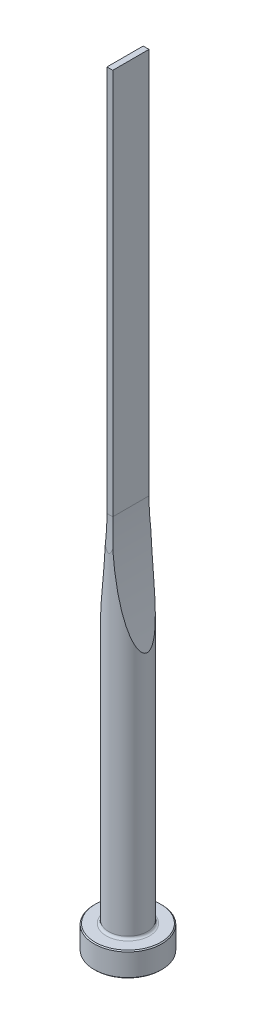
ISO-10303-21;
HEADER;
FILE_DESCRIPTION(('STEP AP214'),'2;1');
FILE_NAME('part.step','',(''),(''),'','','');
FILE_SCHEMA(('AUTOMOTIVE_DESIGN { 1 0 10303 214 1 1 1 1 }'));
ENDSEC;
DATA;
#1=APPLICATION_CONTEXT('core data for automotive mechanical design processes');
#2=APPLICATION_PROTOCOL_DEFINITION('international standard','automotive_design',2000,#1);
#3=PRODUCT_CONTEXT('',#1,'mechanical');
#4=PRODUCT('Part','Part','',(#3));
#5=PRODUCT_RELATED_PRODUCT_CATEGORY('part','',(#4));
#6=PRODUCT_DEFINITION_FORMATION('','',#4);
#7=PRODUCT_DEFINITION_CONTEXT('part definition',#1,'design');
#8=PRODUCT_DEFINITION('design','',#6,#7);
#9=PRODUCT_DEFINITION_SHAPE('','',#8);
#10=(LENGTH_UNIT() NAMED_UNIT(*) SI_UNIT(.MILLI.,.METRE.));
#11=(NAMED_UNIT(*) PLANE_ANGLE_UNIT() SI_UNIT($,.RADIAN.));
#12=(NAMED_UNIT(*) SI_UNIT($,.STERADIAN.) SOLID_ANGLE_UNIT());
#13=UNCERTAINTY_MEASURE_WITH_UNIT(LENGTH_MEASURE(1.E-05),#10,'distance_accuracy_value','');
#14=(GEOMETRIC_REPRESENTATION_CONTEXT(3) GLOBAL_UNCERTAINTY_ASSIGNED_CONTEXT((#13)) GLOBAL_UNIT_ASSIGNED_CONTEXT((#10,
#11,#12)) REPRESENTATION_CONTEXT('',''));
#15=CARTESIAN_POINT('',(0.,0.,0.));
#16=DIRECTION('',(0.,0.,1.));
#17=DIRECTION('',(1.,0.,0.));
#18=AXIS2_PLACEMENT_3D('',#15,#16,#17);
#19=CARTESIAN_POINT('',(0.,0.,0.));
#20=DIRECTION('',(0.,1.,0.));
#21=DIRECTION('',(-1.,0.,0.));
#22=AXIS2_PLACEMENT_3D('',#19,#20,#21);
#23=PLANE('',#22);
#24=CARTESIAN_POINT('',(0.,0.,0.));
#25=DIRECTION('',(0.,1.,0.));
#26=DIRECTION('',(-1.,0.,0.));
#27=AXIS2_PLACEMENT_3D('',#24,#25,#26);
#28=CIRCLE('',#27,6.8);
#29=CARTESIAN_POINT('',(-6.8,0.,0.));
#30=VERTEX_POINT('',#29);
#31=EDGE_CURVE('E133',#30,#30,#28,.T.);
#32=ORIENTED_EDGE('',*,*,#31,.F.);
#33=EDGE_LOOP('',(#32));
#34=FACE_BOUND('',#33,.T.);
#35=ADVANCED_FACE('F32',(#34),#23,.F.);
#36=CARTESIAN_POINT('',(0.,0.,0.));
#37=DIRECTION('',(0.,1.,0.));
#38=DIRECTION('',(-1.,0.,0.));
#39=AXIS2_PLACEMENT_3D('',#36,#37,#38);
#40=CONICAL_SURFACE('',#39,6.8,0.785398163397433);
#41=CARTESIAN_POINT('',(0.,0.200000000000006,0.));
#42=DIRECTION('',(0.,1.,0.));
#43=DIRECTION('',(-1.,0.,0.));
#44=AXIS2_PLACEMENT_3D('',#41,#42,#43);
#45=CIRCLE('',#44,7.);
#46=CARTESIAN_POINT('',(-7.,0.200000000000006,0.));
#47=VERTEX_POINT('',#46);
#48=EDGE_CURVE('E130',#47,#47,#45,.T.);
#49=ORIENTED_EDGE('',*,*,#48,.F.);
#50=EDGE_LOOP('',(#49));
#51=FACE_BOUND('',#50,.T.);
#52=ORIENTED_EDGE('',*,*,#31,.T.);
#53=EDGE_LOOP('',(#52));
#54=FACE_BOUND('',#53,.T.);
#55=ADVANCED_FACE('F171',(#51,#54),#40,.T.);
#56=CARTESIAN_POINT('',(0.,160.,0.));
#57=DIRECTION('',(0.,1.,0.));
#58=DIRECTION('',(-1.,0.,0.));
#59=AXIS2_PLACEMENT_3D('',#56,#57,#58);
#60=CYLINDRICAL_SURFACE('',#59,7.);
#61=CARTESIAN_POINT('',(0.,4.8,0.));
#62=DIRECTION('',(0.,1.,0.));
#63=DIRECTION('',(-1.,0.,0.));
#64=AXIS2_PLACEMENT_3D('',#61,#62,#63);
#65=CIRCLE('',#64,7.);
#66=CARTESIAN_POINT('',(-7.,4.8,0.));
#67=VERTEX_POINT('',#66);
#68=EDGE_CURVE('E127',#67,#67,#65,.T.);
#69=ORIENTED_EDGE('',*,*,#68,.F.);
#70=EDGE_LOOP('',(#69));
#71=FACE_BOUND('',#70,.T.);
#72=ORIENTED_EDGE('',*,*,#48,.T.);
#73=EDGE_LOOP('',(#72));
#74=FACE_BOUND('',#73,.T.);
#75=ADVANCED_FACE('F176',(#71,#74),#60,.T.);
#76=CARTESIAN_POINT('',(0.,4.8,0.));
#77=DIRECTION('',(0.,-1.,0.));
#78=DIRECTION('',(1.,0.,0.));
#79=AXIS2_PLACEMENT_3D('',#76,#77,#78);
#80=CONICAL_SURFACE('',#79,7.,0.785398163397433);
#81=CARTESIAN_POINT('',(0.,5.,0.));
#82=DIRECTION('',(0.,1.,0.));
#83=DIRECTION('',(-1.,0.,0.));
#84=AXIS2_PLACEMENT_3D('',#81,#82,#83);
#85=CIRCLE('',#84,6.8);
#86=CARTESIAN_POINT('',(-6.8,5.00000000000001,0.));
#87=VERTEX_POINT('',#86);
#88=EDGE_CURVE('E124',#87,#87,#85,.T.);
#89=ORIENTED_EDGE('',*,*,#88,.F.);
#90=EDGE_LOOP('',(#89));
#91=FACE_BOUND('',#90,.T.);
#92=ORIENTED_EDGE('',*,*,#68,.T.);
#93=EDGE_LOOP('',(#92));
#94=FACE_BOUND('',#93,.T.);
#95=ADVANCED_FACE('F183',(#91,#94),#80,.T.);
#96=CARTESIAN_POINT('',(6.8,5.,0.));
#97=DIRECTION('',(0.,-1.,0.));
#98=DIRECTION('',(1.,0.,0.));
#99=AXIS2_PLACEMENT_3D('',#96,#97,#98);
#100=PLANE('',#99);
#101=CARTESIAN_POINT('',(0.,5.,0.));
#102=DIRECTION('',(0.,1.,0.));
#103=DIRECTION('',(-1.,0.,0.));
#104=AXIS2_PLACEMENT_3D('',#101,#102,#103);
#105=CIRCLE('',#104,4.50000000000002);
#106=CARTESIAN_POINT('',(-4.50000000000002,5.,0.));
#107=VERTEX_POINT('',#106);
#108=EDGE_CURVE('E121',#107,#107,#105,.T.);
#109=ORIENTED_EDGE('',*,*,#108,.F.);
#110=EDGE_LOOP('',(#109));
#111=FACE_BOUND('',#110,.T.);
#112=ORIENTED_EDGE('',*,*,#88,.T.);
#113=EDGE_LOOP('',(#112));
#114=FACE_BOUND('',#113,.T.);
#115=ADVANCED_FACE('F190',(#111,#114),#100,.F.);
#116=CARTESIAN_POINT('',(0.,5.5,0.));
#117=DIRECTION('',(0.,1.,0.));
#118=DIRECTION('',(-1.,0.,0.));
#119=AXIS2_PLACEMENT_3D('',#116,#117,#118);
#120=TOROIDAL_SURFACE('',#119,4.50000000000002,0.5);
#121=CARTESIAN_POINT('',(0.,5.50000000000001,0.));
#122=DIRECTION('',(0.,1.,0.));
#123=DIRECTION('',(-1.,0.,0.));
#124=AXIS2_PLACEMENT_3D('',#121,#122,#123);
#125=CIRCLE('',#124,4.00000000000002);
#126=CARTESIAN_POINT('',(-4.00000000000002,5.50000000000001,0.));
#127=VERTEX_POINT('',#126);
#128=EDGE_CURVE('E112',#127,#127,#125,.T.);
#129=ORIENTED_EDGE('',*,*,#128,.F.);
#130=EDGE_LOOP('',(#129));
#131=FACE_BOUND('',#130,.T.);
#132=ORIENTED_EDGE('',*,*,#108,.T.);
#133=EDGE_LOOP('',(#132));
#134=FACE_BOUND('',#133,.T.);
#135=ADVANCED_FACE('F168',(#131,#134),#120,.F.);
#136=CARTESIAN_POINT('',(0.,160.,0.));
#137=DIRECTION('',(0.,1.,0.));
#138=DIRECTION('',(-1.,0.,0.));
#139=AXIS2_PLACEMENT_3D('',#136,#137,#138);
#140=CYLINDRICAL_SURFACE('',#139,4.00000000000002);
#141=CARTESIAN_POINT('',(4.00000000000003,55.4961227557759,0.));
#142=CARTESIAN_POINT('',(3.99999564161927,55.4961377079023,0.0724134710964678));
#143=CARTESIAN_POINT('',(3.99800322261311,55.5031762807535,0.144924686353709));
#144=CARTESIAN_POINT('',(3.99031322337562,55.5303792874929,0.287279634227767));
#145=CARTESIAN_POINT('',(3.98460601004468,55.5505778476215,0.357115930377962));
#146=CARTESIAN_POINT('',(3.96856971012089,55.6074534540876,0.507306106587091));
#147=CARTESIAN_POINT('',(3.95749573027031,55.646793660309,0.58655198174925));
#148=CARTESIAN_POINT('',(3.93217275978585,55.7370671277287,0.737506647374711));
#149=CARTESIAN_POINT('',(3.91791778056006,55.7880222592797,0.809200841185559));
#150=CARTESIAN_POINT('',(3.88934869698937,55.8905537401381,0.936273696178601));
#151=CARTESIAN_POINT('',(3.87530210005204,55.9411185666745,0.992548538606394));
#152=CARTESIAN_POINT('',(3.84606514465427,56.0467582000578,1.10041297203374));
#153=CARTESIAN_POINT('',(3.83087387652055,56.1018365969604,1.15199876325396));
#154=CARTESIAN_POINT('',(3.79965336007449,56.2154818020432,1.25113546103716));
#155=CARTESIAN_POINT('',(3.78362230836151,56.2740561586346,1.29867705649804));
#156=CARTESIAN_POINT('',(3.75099135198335,56.3937815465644,1.39011393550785));
#157=CARTESIAN_POINT('',(3.73439162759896,56.4549317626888,1.43401035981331));
#158=CARTESIAN_POINT('',(3.69302416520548,56.6079842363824,1.53818457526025));
#159=CARTESIAN_POINT('',(3.66802493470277,56.7010453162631,1.59666444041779));
#160=CARTESIAN_POINT('',(3.61751018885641,56.8903465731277,1.70802585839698));
#161=CARTESIAN_POINT('',(3.59199442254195,56.9865883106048,1.76090460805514));
#162=CARTESIAN_POINT('',(3.54064570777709,57.1816080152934,1.86200096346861));
#163=CARTESIAN_POINT('',(3.51481230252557,57.2803899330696,1.9102106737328));
#164=CARTESIAN_POINT('',(3.46302756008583,57.4798165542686,2.00255699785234));
#165=CARTESIAN_POINT('',(3.4370762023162,57.5804615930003,2.04669286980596));
#166=CARTESIAN_POINT('',(3.35898443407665,57.8855399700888,2.17422236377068));
#167=CARTESIAN_POINT('',(3.30684459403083,58.0922129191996,2.25228414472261));
#168=CARTESIAN_POINT('',(3.22913547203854,58.4050098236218,2.36106736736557));
#169=CARTESIAN_POINT('',(3.20332878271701,58.5096864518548,2.39592801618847));
#170=CARTESIAN_POINT('',(3.15191115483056,58.7198812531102,2.4631794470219));
#171=CARTESIAN_POINT('',(3.12630021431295,58.8253994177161,2.4955702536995));
#172=CARTESIAN_POINT('',(3.05370800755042,59.1268778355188,2.58465377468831));
#173=CARTESIAN_POINT('',(3.00701123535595,59.323696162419,2.63867658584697));
#174=CARTESIAN_POINT('',(2.91459477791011,59.7191969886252,2.74041090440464));
#175=CARTESIAN_POINT('',(2.86887523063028,59.9178797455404,2.78812152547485));
#176=CARTESIAN_POINT('',(2.77851421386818,60.3167970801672,2.87818171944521));
#177=CARTESIAN_POINT('',(2.7338732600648,60.5170323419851,2.92052876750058));
#178=CARTESIAN_POINT('',(2.64577308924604,60.9186934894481,3.00056953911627));
#179=CARTESIAN_POINT('',(2.60231393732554,61.1201194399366,3.03826300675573));
#180=CARTESIAN_POINT('',(2.47361423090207,61.7267618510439,3.14543682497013));
#181=CARTESIAN_POINT('',(2.3902515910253,62.133459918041,3.20881732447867));
#182=CARTESIAN_POINT('',(2.22888225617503,62.9495283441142,3.32292076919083));
#183=CARTESIAN_POINT('',(2.15087426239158,63.3588980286,3.37364679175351));
#184=CARTESIAN_POINT('',(2.00010529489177,64.1812134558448,3.4651666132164));
#185=CARTESIAN_POINT('',(1.92736389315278,64.5941667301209,3.50592458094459));
#186=CARTESIAN_POINT('',(1.78755023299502,65.4217659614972,3.57922983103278));
#187=CARTESIAN_POINT('',(1.72047824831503,65.8364119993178,3.61177671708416));
#188=CARTESIAN_POINT('',(1.5921699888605,66.6664957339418,3.67014347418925));
#189=CARTESIAN_POINT('',(1.53092595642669,67.0819316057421,3.69597236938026));
#190=CARTESIAN_POINT('',(1.41422203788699,67.913914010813,3.74217950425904));
#191=CARTESIAN_POINT('',(1.3587621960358,68.3304605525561,3.76255770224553));
#192=CARTESIAN_POINT('',(1.23052997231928,69.3480416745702,3.80686626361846));
#193=CARTESIAN_POINT('',(1.16088260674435,69.9495757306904,3.82841184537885));
#194=CARTESIAN_POINT('',(1.03372424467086,71.1541488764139,3.86468251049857));
#195=CARTESIAN_POINT('',(0.97621388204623,71.7571880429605,3.87940723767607));
#196=CARTESIAN_POINT('',(0.873363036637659,72.9645352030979,3.90384820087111));
#197=CARTESIAN_POINT('',(0.828025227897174,73.5688434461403,3.91356333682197));
#198=CARTESIAN_POINT('',(0.749563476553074,74.7782873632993,3.92934517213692));
#199=CARTESIAN_POINT('',(0.71643933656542,75.3834230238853,3.93541193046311));
#200=CARTESIAN_POINT('',(0.662359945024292,76.5956185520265,3.94487439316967));
#201=CARTESIAN_POINT('',(0.641432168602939,77.2026796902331,3.94826407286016));
#202=CARTESIAN_POINT('',(0.611870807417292,78.4171113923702,3.95295302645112));
#203=CARTESIAN_POINT('',(0.603237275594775,79.024481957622,3.9542522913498));
#204=CARTESIAN_POINT('',(0.598268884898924,80.2391651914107,3.95500702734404));
#205=CARTESIAN_POINT('',(0.60193181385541,80.8464778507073,3.95446283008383));
#206=CARTESIAN_POINT('',(0.621549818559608,82.0608983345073,3.9514269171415));
#207=CARTESIAN_POINT('',(0.637504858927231,82.6680061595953,3.94893520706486));
#208=CARTESIAN_POINT('',(0.681565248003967,83.8780670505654,3.94156883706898));
#209=CARTESIAN_POINT('',(0.709596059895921,84.4810229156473,3.93670877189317));
#210=CARTESIAN_POINT('',(0.777780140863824,85.6862209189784,3.9238072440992));
#211=CARTESIAN_POINT('',(0.817933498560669,86.2884630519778,3.91576575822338));
#212=CARTESIAN_POINT('',(0.910362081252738,87.4922231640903,3.89531575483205));
#213=CARTESIAN_POINT('',(0.96264285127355,88.0937406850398,3.88290523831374));
#214=CARTESIAN_POINT('',(1.07928092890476,89.2954434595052,3.85211559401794));
#215=CARTESIAN_POINT('',(1.14363798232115,89.8956287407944,3.83373659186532));
#216=CARTESIAN_POINT('',(1.28415058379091,91.0923779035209,3.78898225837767));
#217=CARTESIAN_POINT('',(1.36026767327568,91.6889472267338,3.76263273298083));
#218=CARTESIAN_POINT('',(1.52436736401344,92.8799481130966,3.69919550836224));
#219=CARTESIAN_POINT('',(1.61235107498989,93.4743794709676,3.66210680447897));
#220=CARTESIAN_POINT('',(1.79995345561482,94.6598583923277,3.57365007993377));
#221=CARTESIAN_POINT('',(1.89956189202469,95.2509084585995,3.52229456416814));
#222=CARTESIAN_POINT('',(2.05751784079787,96.134385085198,3.43078434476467));
#223=CARTESIAN_POINT('',(2.11158852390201,96.4283349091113,3.39787168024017));
#224=CARTESIAN_POINT('',(2.22252257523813,97.0150103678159,3.32637407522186));
#225=CARTESIAN_POINT('',(2.27938579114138,97.3077360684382,3.28778944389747));
#226=CARTESIAN_POINT('',(2.37335149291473,97.7789740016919,3.22011433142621));
#227=CARTESIAN_POINT('',(2.40960878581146,97.957955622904,3.19310843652));
#228=CARTESIAN_POINT('',(2.48312261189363,98.3152719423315,3.13628169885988));
#229=CARTESIAN_POINT('',(2.52037916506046,98.4936066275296,3.10646079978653));
#230=CARTESIAN_POINT('',(2.59587928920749,98.849611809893,3.04365297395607));
#231=CARTESIAN_POINT('',(2.63412337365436,99.0272819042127,3.01066437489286));
#232=CARTESIAN_POINT('',(2.71153832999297,99.3817235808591,2.94113375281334));
#233=CARTESIAN_POINT('',(2.75070919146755,99.5584951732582,2.90459176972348));
#234=CARTESIAN_POINT('',(2.83003427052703,99.9114520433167,2.82736273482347));
#235=CARTESIAN_POINT('',(2.87019091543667,100.087634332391,2.78666446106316));
#236=CARTESIAN_POINT('',(2.9513077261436,100.438668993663,2.70060749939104));
#237=CARTESIAN_POINT('',(2.99226785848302,100.613521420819,2.65524900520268));
#238=CARTESIAN_POINT('',(3.07485965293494,100.961434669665,2.55915064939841));
#239=CARTESIAN_POINT('',(3.11649075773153,101.134496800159,2.50841507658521));
#240=CARTESIAN_POINT('',(3.20030527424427,101.478470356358,2.40056525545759));
#241=CARTESIAN_POINT('',(3.24248860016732,101.649382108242,2.34345198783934));
#242=CARTESIAN_POINT('',(3.32761650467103,101.990047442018,2.2209449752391));
#243=CARTESIAN_POINT('',(3.37056449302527,102.159773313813,2.1554756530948));
#244=CARTESIAN_POINT('',(3.45650933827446,102.495378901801,2.01478368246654));
#245=CARTESIAN_POINT('',(3.49950619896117,102.661254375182,1.93955082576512));
#246=CARTESIAN_POINT('',(3.584663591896,102.986063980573,1.7772405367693));
#247=CARTESIAN_POINT('',(3.62682777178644,103.145036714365,1.69024459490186));
#248=CARTESIAN_POINT('',(3.68879218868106,103.37623468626,1.54772713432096));
#249=CARTESIAN_POINT('',(3.70921535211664,103.45202482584,1.49826783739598));
#250=CARTESIAN_POINT('',(3.74941531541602,103.600462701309,1.39462493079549));
#251=CARTESIAN_POINT('',(3.76919236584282,103.673111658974,1.34044318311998));
#252=CARTESIAN_POINT('',(3.81294137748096,103.833065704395,1.21132384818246));
#253=CARTESIAN_POINT('',(3.83662600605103,103.919114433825,1.13470379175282));
#254=CARTESIAN_POINT('',(3.88140503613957,104.080952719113,0.970527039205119));
#255=CARTESIAN_POINT('',(3.90250393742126,104.156760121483,0.882989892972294));
#256=CARTESIAN_POINT('',(3.9339875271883,104.26941489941,0.726495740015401));
#257=CARTESIAN_POINT('',(3.94559651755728,104.310816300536,0.66110458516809));
#258=CARTESIAN_POINT('',(3.96605720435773,104.383629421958,0.524532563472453));
#259=CARTESIAN_POINT('',(3.97491309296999,104.415056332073,0.453360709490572));
#260=CARTESIAN_POINT('',(3.98768281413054,104.460314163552,0.319456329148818));
#261=CARTESIAN_POINT('',(3.99220018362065,104.47629734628,0.257519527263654));
#262=CARTESIAN_POINT('',(3.99832424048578,104.497956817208,0.131735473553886));
#263=CARTESIAN_POINT('',(3.99993382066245,104.503643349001,0.0678901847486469));
#264=CARTESIAN_POINT('',(4.00006223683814,104.504097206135,-0.0599473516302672));
#265=CARTESIAN_POINT('',(3.99857607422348,104.498846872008,-0.123939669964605));
#266=CARTESIAN_POINT('',(3.99267617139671,104.477981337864,-0.25007580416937));
#267=CARTESIAN_POINT('',(3.98825964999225,104.462356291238,-0.312217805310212));
#268=CARTESIAN_POINT('',(3.97527309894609,104.416334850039,-0.450974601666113));
#269=CARTESIAN_POINT('',(3.9658662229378,104.382955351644,-0.526508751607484));
#270=CARTESIAN_POINT('',(3.94398370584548,104.305070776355,-0.671103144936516));
#271=CARTESIAN_POINT('',(3.93150139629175,104.260541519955,-0.740148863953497));
#272=CARTESIAN_POINT('',(3.9065601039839,104.171249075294,-0.861383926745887));
#273=CARTESIAN_POINT('',(3.89441124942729,104.127642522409,-0.91451011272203));
#274=CARTESIAN_POINT('',(3.86899878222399,104.036132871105,-1.0166720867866));
#275=CARTESIAN_POINT('',(3.85573433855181,103.988226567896,-1.06570477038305));
#276=CARTESIAN_POINT('',(3.82836739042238,103.889044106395,-1.16018395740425));
#277=CARTESIAN_POINT('',(3.8142630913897,103.837760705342,-1.20562226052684));
#278=CARTESIAN_POINT('',(3.7854632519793,103.732660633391,-1.29320936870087));
#279=CARTESIAN_POINT('',(3.770767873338,103.678844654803,-1.33535906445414));
#280=CARTESIAN_POINT('',(3.73512522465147,103.547818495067,-1.43264720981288));
#281=CARTESIAN_POINT('',(3.71397435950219,103.469668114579,-1.48644230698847));
#282=CARTESIAN_POINT('',(3.67112376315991,103.31045464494,-1.5893219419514));
#283=CARTESIAN_POINT('',(3.64942378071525,103.229390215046,-1.63840427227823));
#284=CARTESIAN_POINT('',(3.58375426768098,102.982643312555,-1.77976912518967));
#285=CARTESIAN_POINT('',(3.53927682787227,102.813633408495,-1.86600919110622));
#286=CARTESIAN_POINT('',(3.44977897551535,102.46933164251,-2.02668892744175));
#287=CARTESIAN_POINT('',(3.40475697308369,102.294013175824,-2.10106902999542));
#288=CARTESIAN_POINT('',(3.31494343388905,101.93974151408,-2.2400859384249));
#289=CARTESIAN_POINT('',(3.27015171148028,101.760792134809,-2.30473242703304));
#290=CARTESIAN_POINT('',(3.18612289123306,101.420579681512,-2.41931179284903));
#291=CARTESIAN_POINT('',(3.14683114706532,101.259608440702,-2.47008185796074));
#292=CARTESIAN_POINT('',(3.06878971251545,100.93597257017,-2.56639084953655));
#293=CARTESIAN_POINT('',(3.03004006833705,100.773307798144,-2.61192933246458));
#294=CARTESIAN_POINT('',(2.91473222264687,100.283156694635,-2.74186435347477));
#295=CARTESIAN_POINT('',(2.83914992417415,99.953654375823,-2.81953466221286));
#296=CARTESIAN_POINT('',(2.69097804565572,99.290403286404,-2.96126843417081));
#297=CARTESIAN_POINT('',(2.6183949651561,98.9566471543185,-3.02530347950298));
#298=CARTESIAN_POINT('',(2.47666397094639,98.2864694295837,-3.1423844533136));
#299=CARTESIAN_POINT('',(2.40751642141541,97.9500475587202,-3.19542921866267));
#300=CARTESIAN_POINT('',(2.27265074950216,97.2742142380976,-3.29271652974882));
#301=CARTESIAN_POINT('',(2.20694335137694,96.9347968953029,-3.33693263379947));
#302=CARTESIAN_POINT('',(2.07929343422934,96.2543637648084,-3.41793037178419));
#303=CARTESIAN_POINT('',(2.01735109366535,95.9133479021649,-3.45471165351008));
#304=CARTESIAN_POINT('',(1.89739134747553,95.230470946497,-3.52202050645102));
#305=CARTESIAN_POINT('',(1.83936902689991,94.8886114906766,-3.55255600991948));
#306=CARTESIAN_POINT('',(1.7272177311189,94.2038359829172,-3.60841172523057));
#307=CARTESIAN_POINT('',(1.67308875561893,93.860919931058,-3.63373193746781));
#308=CARTESIAN_POINT('',(1.53321874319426,92.9402255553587,-3.69573828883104));
#309=CARTESIAN_POINT('',(1.45106925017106,92.3616278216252,-3.72841306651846));
#310=CARTESIAN_POINT('',(1.29800476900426,91.2024765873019,-3.78441543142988));
#311=CARTESIAN_POINT('',(1.22709062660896,90.6219229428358,-3.80774231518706));
#312=CARTESIAN_POINT('',(1.09655325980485,89.4591433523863,-3.84736572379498));
#313=CARTESIAN_POINT('',(1.03693331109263,88.8769169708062,-3.86366021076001));
#314=CARTESIAN_POINT('',(0.929055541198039,87.7113092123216,-3.89100856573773));
#315=CARTESIAN_POINT('',(0.880797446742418,87.1279278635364,-3.9020625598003));
#316=CARTESIAN_POINT('',(0.795592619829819,85.9592214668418,-3.92032303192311));
#317=CARTESIAN_POINT('',(0.75866649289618,85.373894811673,-3.92752251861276));
#318=CARTESIAN_POINT('',(0.6962620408,84.2026016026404,-3.93906396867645));
#319=CARTESIAN_POINT('',(0.670783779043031,83.6166350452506,-3.94340591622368));
#320=CARTESIAN_POINT('',(0.631290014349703,82.4444000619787,-3.94992062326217));
#321=CARTESIAN_POINT('',(0.617272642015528,81.8581317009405,-3.95209373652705));
#322=CARTESIAN_POINT('',(0.600699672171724,80.6854307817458,-3.95464664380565));
#323=CARTESIAN_POINT('',(0.598144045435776,80.0989982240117,-3.95502644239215));
#324=CARTESIAN_POINT('',(0.604484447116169,78.9282455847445,-3.95406229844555));
#325=CARTESIAN_POINT('',(0.613340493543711,78.3439252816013,-3.95272437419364));
#326=CARTESIAN_POINT('',(0.642431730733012,77.1755736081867,-3.9481006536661));
#327=CARTESIAN_POINT('',(0.662666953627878,76.5915422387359,-3.94481485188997));
#328=CARTESIAN_POINT('',(0.71451277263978,75.423890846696,-3.93575467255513));
#329=CARTESIAN_POINT('',(0.746125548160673,74.8402709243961,-3.92997981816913));
#330=CARTESIAN_POINT('',(0.820710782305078,73.673802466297,-3.91508384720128));
#331=CARTESIAN_POINT('',(0.863683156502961,73.0909539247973,-3.90596275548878));
#332=CARTESIAN_POINT('',(0.960884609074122,71.9272467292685,-3.88319332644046));
#333=CARTESIAN_POINT('',(1.01509506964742,71.3463863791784,-3.86955245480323));
#334=CARTESIAN_POINT('',(1.13478238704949,70.1859765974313,-3.83616145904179));
#335=CARTESIAN_POINT('',(1.20025961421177,69.6064272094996,-3.81641113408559));
#336=CARTESIAN_POINT('',(1.34239625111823,68.4492480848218,-3.76876527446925));
#337=CARTESIAN_POINT('',(1.41905154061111,67.8716177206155,-3.74087273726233));
#338=CARTESIAN_POINT('',(1.58346740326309,66.7185860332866,-3.67430628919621));
#339=CARTESIAN_POINT('',(1.67122682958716,66.1431844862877,-3.63563349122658));
#340=CARTESIAN_POINT('',(1.78780397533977,65.4255342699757,-3.57832702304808));
#341=CARTESIAN_POINT('',(1.8114945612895,65.2818994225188,-3.56640112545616));
#342=CARTESIAN_POINT('',(1.85955822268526,64.9948285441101,-3.5415782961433));
#343=CARTESIAN_POINT('',(1.88393129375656,64.8513925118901,-3.52868137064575));
#344=CARTESIAN_POINT('',(1.95806984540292,64.4213981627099,-3.48842778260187));
#345=CARTESIAN_POINT('',(2.00885380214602,64.1351589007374,-3.45950872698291));
#346=CARTESIAN_POINT('',(2.11307968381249,63.5637829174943,-3.39685068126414));
#347=CARTESIAN_POINT('',(2.16652076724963,63.2786458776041,-3.36311321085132));
#348=CARTESIAN_POINT('',(2.27601482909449,62.7096094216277,-3.28999715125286));
#349=CARTESIAN_POINT('',(2.33206772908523,62.4257099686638,-3.25061873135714));
#350=CARTESIAN_POINT('',(2.46860643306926,61.7512532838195,-3.14893656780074));
#351=CARTESIAN_POINT('',(2.55024834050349,61.3613673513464,-3.08362075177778));
#352=CARTESIAN_POINT('',(2.67606846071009,60.7796556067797,-2.97350542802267));
#353=CARTESIAN_POINT('',(2.71855977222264,60.5863071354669,-2.93478510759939));
#354=CARTESIAN_POINT('',(2.804599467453,60.2008426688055,-2.85267651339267));
#355=CARTESIAN_POINT('',(2.84814781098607,60.0087266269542,-2.80928841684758));
#356=CARTESIAN_POINT('',(2.9537423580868,59.5498445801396,-2.69877172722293));
#357=CARTESIAN_POINT('',(3.01625290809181,59.2837977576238,-2.62906697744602));
#358=CARTESIAN_POINT('',(3.14290843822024,58.7554491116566,-2.47629605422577));
#359=CARTESIAN_POINT('',(3.2070555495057,58.4931529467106,-2.39321162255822));
#360=CARTESIAN_POINT('',(3.30572146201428,58.0972866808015,-2.25292733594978));
#361=CARTESIAN_POINT('',(3.33993028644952,57.9614070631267,-2.20202594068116));
#362=CARTESIAN_POINT('',(3.40842047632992,57.6919800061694,-2.09445657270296));
#363=CARTESIAN_POINT('',(3.44270182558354,57.5584320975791,-2.03778977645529));
#364=CARTESIAN_POINT('',(3.51102218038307,57.2947484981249,-1.91767763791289));
#365=CARTESIAN_POINT('',(3.54506157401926,57.1646052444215,-1.85424925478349));
#366=CARTESIAN_POINT('',(3.61259911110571,56.9086691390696,-1.71896967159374));
#367=CARTESIAN_POINT('',(3.64609760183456,56.7828734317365,-1.64712414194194));
#368=CARTESIAN_POINT('',(3.70554577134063,56.5614784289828,-1.50780992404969));
#369=CARTESIAN_POINT('',(3.73169584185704,56.4647668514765,-1.4422104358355));
#370=CARTESIAN_POINT('',(3.78277813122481,56.2770269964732,-1.30236256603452));
#371=CARTESIAN_POINT('',(3.80770778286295,56.1860105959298,-1.22809697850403));
#372=CARTESIAN_POINT('',(3.85567653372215,56.0118658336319,-1.06810478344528));
#373=CARTESIAN_POINT('',(3.87869011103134,55.9288421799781,-0.982254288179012));
#374=CARTESIAN_POINT('',(3.92082845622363,55.7775449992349,-0.797495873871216));
#375=CARTESIAN_POINT('',(3.93996853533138,55.709213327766,-0.698642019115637));
#376=CARTESIAN_POINT('',(3.96488637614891,55.6205363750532,-0.532363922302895));
#377=CARTESIAN_POINT('',(3.97287767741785,55.5921680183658,-0.46958525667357));
#378=CARTESIAN_POINT('',(3.98603728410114,55.5455105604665,-0.340150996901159));
#379=CARTESIAN_POINT('',(3.99121331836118,55.5271938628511,-0.273506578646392));
#380=CARTESIAN_POINT('',(3.99645206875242,55.5086643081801,-0.171843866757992));
#381=CARTESIAN_POINT('',(3.99777744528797,55.5039786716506,-0.137668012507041));
#382=CARTESIAN_POINT('',(3.99955257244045,55.4977038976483,-0.0690022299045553));
#383=CARTESIAN_POINT('',(4.00000207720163,55.4961156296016,-0.0345122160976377));
#384=CARTESIAN_POINT('',(4.00000000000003,55.4961227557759,0.));
#385=B_SPLINE_CURVE_WITH_KNOTS('',3,(#141,#142,#143,#144,#145,#146,#147,#148,#149,#150,#151,
#152,#153,#154,#155,#156,#157,#158,#159,#160,#161,#162,#163,#164,#165,#166,#167,#168,#169,#170,
#171,#172,#173,#174,#175,#176,#177,#178,#179,#180,#181,#182,#183,#184,#185,#186,#187,#188,#189,
#190,#191,#192,#193,#194,#195,#196,#197,#198,#199,#200,#201,#202,#203,#204,#205,#206,#207,#208,
#209,#210,#211,#212,#213,#214,#215,#216,#217,#218,#219,#220,#221,#222,#223,#224,#225,#226,#227,
#228,#229,#230,#231,#232,#233,#234,#235,#236,#237,#238,#239,#240,#241,#242,#243,#244,#245,#246,
#247,#248,#249,#250,#251,#252,#253,#254,#255,#256,#257,#258,#259,#260,#261,#262,#263,#264,#265,
#266,#267,#268,#269,#270,#271,#272,#273,#274,#275,#276,#277,#278,#279,#280,#281,#282,#283,#284,
#285,#286,#287,#288,#289,#290,#291,#292,#293,#294,#295,#296,#297,#298,#299,#300,#301,#302,#303,
#304,#305,#306,#307,#308,#309,#310,#311,#312,#313,#314,#315,#316,#317,#318,#319,#320,#321,#322,
#323,#324,#325,#326,#327,#328,#329,#330,#331,#332,#333,#334,#335,#336,#337,#338,#339,#340,#341,
#342,#343,#344,#345,#346,#347,#348,#349,#350,#351,#352,#353,#354,#355,#356,#357,#358,#359,#360,
#361,#362,#363,#364,#365,#366,#367,#368,#369,#370,#371,#372,#373,#374,#375,#376,#377,#378,#379,
#380,#381,#382,#383,#384),.UNSPECIFIED.,.T.,.F.,(4,2,2,2,2,2,2,2,2,2,2,2,2,2,2,2,2,2,2,2,2,2,2,
2,2,2,2,2,2,2,2,2,2,2,2,2,2,2,2,2,2,2,2,2,2,2,2,2,2,2,2,2,2,2,2,2,2,2,2,2,2,2,2,2,2,2,2,2,2,2,2,
2,2,2,2,2,2,2,2,2,2,2,2,2,2,2,2,2,2,2,2,2,2,2,2,2,2,2,2,2,2,2,2,2,2,2,2,2,2,2,2,2,2,2,2,2,2,2,2,
2,2,4),(0.,0.217071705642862,0.434708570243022,0.700672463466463,0.967141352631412,
1.19765545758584,1.42835472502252,1.65957152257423,1.89071568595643,2.22861679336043,
2.56668621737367,2.90531769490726,3.24401072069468,3.92450632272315,4.26441084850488,
4.60431197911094,5.23228898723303,5.86035407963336,6.48871373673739,7.11710793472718,
8.37667122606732,9.63592791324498,10.8996467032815,12.1634264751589,13.4254997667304,
14.6875827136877,16.5052028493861,18.3229178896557,20.1410319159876,21.9591165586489,
23.781281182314,25.6034536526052,27.4252983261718,29.2471377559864,31.0578896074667,
32.8686546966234,34.6802493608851,36.4918058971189,38.2975588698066,40.1034808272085,
41.9078248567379,42.8098366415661,43.7117992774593,44.2655877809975,44.8193873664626,
45.3734809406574,45.9275682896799,46.483193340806,47.0387953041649,47.5939574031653,
48.1490342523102,48.7095441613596,49.2706449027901,49.8280406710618,50.1062328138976,
50.3843157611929,50.7365369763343,51.0881362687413,51.3222456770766,51.5559968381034,
51.7475528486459,51.9389181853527,52.1305927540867,52.3224495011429,52.5704006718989,
52.81889428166,53.0279863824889,53.2372356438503,53.4469492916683,53.6566059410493,
53.9480075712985,54.2395450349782,54.8234681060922,55.4102374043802,55.9964190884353,
56.516223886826,57.0360727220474,58.0762260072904,59.1185263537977,60.1609369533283,
61.2064242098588,62.2519609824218,63.2961615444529,64.3403620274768,66.0960707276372,
67.8519115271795,69.6082608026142,71.3645678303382,73.1240497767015,74.8835414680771,
76.6427461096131,78.4019462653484,80.1549996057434,81.9080578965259,83.6614521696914,
85.4148334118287,87.1653327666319,88.9158896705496,90.6658029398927,92.4155356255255,
92.8537216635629,93.291904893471,94.1682875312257,95.0443943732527,95.9204749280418,
97.13111353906,97.7362062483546,98.3412759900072,99.1871473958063,100.034183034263,
100.481319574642,100.92836505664,101.374314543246,101.819965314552,102.17888860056,
102.538537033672,102.902391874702,103.264779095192,103.472139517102,103.678927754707,
103.782354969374,103.885811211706),.UNSPECIFIED.);
#386=CARTESIAN_POINT('',(0.774335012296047,74.4009010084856,-3.92433501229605));
#387=VERTEX_POINT('',#386);
#388=CARTESIAN_POINT('',(0.774335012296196,74.4009010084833,3.92433501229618));
#389=VERTEX_POINT('',#388);
#390=EDGE_CURVE('E138',#387,#389,#385,.T.);
#391=ORIENTED_EDGE('',*,*,#390,.T.);
#392=CARTESIAN_POINT('',(-1.39194109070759,80.,3.74999999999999));
#393=CARTESIAN_POINT('',(-1.39194449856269,80.3340996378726,3.75000007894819));
#394=CARTESIAN_POINT('',(-1.38695792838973,80.668209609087,3.7518609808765));
#395=CARTESIAN_POINT('',(-1.36667392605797,81.3360771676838,3.75929815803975));
#396=CARTESIAN_POINT('',(-1.35137656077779,81.6698347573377,3.76487440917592));
#397=CARTESIAN_POINT('',(-1.3092332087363,82.3374065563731,3.77973662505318));
#398=CARTESIAN_POINT('',(-1.28235776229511,82.6712187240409,3.78903204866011));
#399=CARTESIAN_POINT('',(-1.21470251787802,83.3371930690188,3.81127649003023));
#400=CARTESIAN_POINT('',(-1.17393087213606,83.6693560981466,3.82422336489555));
#401=CARTESIAN_POINT('',(-1.09844611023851,84.1657630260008,3.84630718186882));
#402=CARTESIAN_POINT('',(-1.07085040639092,84.3311442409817,3.85412453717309));
#403=CARTESIAN_POINT('',(-1.00961852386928,84.6608992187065,3.87061811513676));
#404=CARTESIAN_POINT('',(-0.975977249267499,84.8252720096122,3.87929505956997));
#405=CARTESIAN_POINT('',(-0.900897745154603,85.1517938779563,3.8974227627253));
#406=CARTESIAN_POINT('',(-0.859480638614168,85.3139477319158,3.90687138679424));
#407=CARTESIAN_POINT('',(-0.788768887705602,85.5545158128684,3.92153114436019));
#408=CARTESIAN_POINT('',(-0.763786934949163,85.6342087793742,3.92649537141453));
#409=CARTESIAN_POINT('',(-0.710141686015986,85.7923268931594,3.93655330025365));
#410=CARTESIAN_POINT('',(-0.68147996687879,85.8707525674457,3.94164694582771));
#411=CARTESIAN_POINT('',(-0.619110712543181,86.0259141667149,3.95192410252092));
#412=CARTESIAN_POINT('',(-0.585384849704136,86.1026427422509,3.95710787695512));
#413=CARTESIAN_POINT('',(-0.510918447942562,86.2524891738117,3.9674185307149));
#414=CARTESIAN_POINT('',(-0.470205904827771,86.3256199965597,3.97254555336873));
#415=CARTESIAN_POINT('',(-0.405871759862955,86.4217687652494,3.97939443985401));
#416=CARTESIAN_POINT('',(-0.387100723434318,86.4479908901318,3.98127456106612));
#417=CARTESIAN_POINT('',(-0.347340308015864,86.4988380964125,3.98494137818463));
#418=CARTESIAN_POINT('',(-0.326345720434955,86.5234591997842,3.98672783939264));
#419=CARTESIAN_POINT('',(-0.281381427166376,86.5704548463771,3.99015550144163));
#420=CARTESIAN_POINT('',(-0.257378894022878,86.5927987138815,3.99179469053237));
#421=CARTESIAN_POINT('',(-0.206002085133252,86.6332343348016,3.99477391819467));
#422=CARTESIAN_POINT('',(-0.178643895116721,86.6513452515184,3.99611530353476));
#423=CARTESIAN_POINT('',(-0.133196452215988,86.6742305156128,3.99781497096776));
#424=CARTESIAN_POINT('',(-0.116315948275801,86.6813683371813,3.99834625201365));
#425=CARTESIAN_POINT('',(-0.0816311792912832,86.6928863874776,3.99920443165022));
#426=CARTESIAN_POINT('',(-0.0638281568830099,86.6972702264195,3.99953159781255));
#427=CARTESIAN_POINT('',(-0.0275781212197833,86.7028240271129,3.99994619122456));
#428=CARTESIAN_POINT('',(-0.00912739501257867,86.7039706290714,4.00003187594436));
#429=CARTESIAN_POINT('',(0.0276703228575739,86.7028293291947,3.99994663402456));
#430=CARTESIAN_POINT('',(0.0460172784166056,86.7005402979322,3.99977562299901));
#431=CARTESIAN_POINT('',(0.0805943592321,86.693127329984,3.99922251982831));
#432=CARTESIAN_POINT('',(0.0968774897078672,86.6882404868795,3.99885808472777));
#433=CARTESIAN_POINT('',(0.12858131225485,86.6762358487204,3.99796430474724));
#434=CARTESIAN_POINT('',(0.144001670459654,86.6691171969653,3.99743489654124));
#435=CARTESIAN_POINT('',(0.185006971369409,86.6471511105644,3.99580470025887));
#436=CARTESIAN_POINT('',(0.209611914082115,86.6304953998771,3.99457196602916));
#437=CARTESIAN_POINT('',(0.256071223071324,86.5937200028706,3.99186273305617));
#438=CARTESIAN_POINT('',(0.277915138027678,86.5735877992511,3.99038535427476));
#439=CARTESIAN_POINT('',(0.350665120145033,86.4990858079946,3.98494736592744));
#440=CARTESIAN_POINT('',(0.395552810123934,86.4389897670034,3.98061079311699));
#441=CARTESIAN_POINT('',(0.476792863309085,86.3133434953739,3.97168524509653));
#442=CARTESIAN_POINT('',(0.513090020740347,86.2477614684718,3.96709485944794));
#443=CARTESIAN_POINT('',(0.605299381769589,86.0631758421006,3.95438947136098));
#444=CARTESIAN_POINT('',(0.655314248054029,85.9412436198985,3.94623160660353));
#445=CARTESIAN_POINT('',(0.745376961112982,85.6936668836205,3.93019294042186));
#446=CARTESIAN_POINT('',(0.785397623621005,85.5680132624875,3.92231294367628));
#447=CARTESIAN_POINT('',(0.858576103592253,85.3143608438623,3.90694950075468));
#448=CARTESIAN_POINT('',(0.891716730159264,85.1863570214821,3.89946708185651));
#449=CARTESIAN_POINT('',(0.952763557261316,84.9292949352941,3.88499773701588));
#450=CARTESIAN_POINT('',(0.980676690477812,84.8002383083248,3.87801016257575));
#451=CARTESIAN_POINT('',(1.05809609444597,84.4130670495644,3.8578904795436));
#452=CARTESIAN_POINT('',(1.10161068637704,84.1537155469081,3.84552636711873));
#453=CARTESIAN_POINT('',(1.17739914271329,83.6332486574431,3.82298810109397));
#454=CARTESIAN_POINT('',(1.20966805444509,83.3721325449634,3.81281491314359));
#455=CARTESIAN_POINT('',(1.2653378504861,82.8484213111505,3.79470411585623));
#456=CARTESIAN_POINT('',(1.28872293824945,82.5858243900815,3.78677049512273));
#457=CARTESIAN_POINT('',(1.32794213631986,82.0599951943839,3.77319404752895));
#458=CARTESIAN_POINT('',(1.34377550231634,81.7967628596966,3.76755144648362));
#459=CARTESIAN_POINT('',(1.36866096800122,81.2703935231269,3.75858225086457));
#460=CARTESIAN_POINT('',(1.3777246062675,81.0072571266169,3.75525171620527));
#461=CARTESIAN_POINT('',(1.38952938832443,80.480822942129,3.75089945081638));
#462=CARTESIAN_POINT('',(1.39227046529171,80.2175251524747,3.74987774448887));
#463=CARTESIAN_POINT('',(1.3915494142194,79.6912325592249,3.75014538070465));
#464=CARTESIAN_POINT('',(1.38809419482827,79.4282377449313,3.75143214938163));
#465=CARTESIAN_POINT('',(1.37484398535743,78.9024375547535,3.75630869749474));
#466=CARTESIAN_POINT('',(1.36504925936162,78.6396321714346,3.75989838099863));
#467=CARTESIAN_POINT('',(1.3388022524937,78.1170444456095,3.76932382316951));
#468=CARTESIAN_POINT('',(1.3224180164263,77.8572583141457,3.77513659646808));
#469=CARTESIAN_POINT('',(1.28217391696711,77.3382024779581,3.78899593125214));
#470=CARTESIAN_POINT('',(1.25831091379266,77.0789330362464,3.79704343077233));
#471=CARTESIAN_POINT('',(1.20163024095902,76.560824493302,3.81536023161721));
#472=CARTESIAN_POINT('',(1.16879164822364,76.30198783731,3.82563471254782));
#473=CARTESIAN_POINT('',(1.09180587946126,75.7862363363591,3.84832767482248));
#474=CARTESIAN_POINT('',(1.0476682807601,75.5293200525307,3.86074433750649));
#475=CARTESIAN_POINT('',(0.969147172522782,75.1457963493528,3.88091053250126));
#476=CARTESIAN_POINT('',(0.940826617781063,75.0179166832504,3.88791072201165));
#477=CARTESIAN_POINT('',(0.878848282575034,74.7632801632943,3.90238986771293));
#478=CARTESIAN_POINT('',(0.845183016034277,74.6365251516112,3.90986948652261));
#479=CARTESIAN_POINT('',(0.770839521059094,74.3854811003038,3.9252100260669));
#480=CARTESIAN_POINT('',(0.730184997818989,74.2611852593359,3.93306959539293));
#481=CARTESIAN_POINT('',(0.661250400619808,74.0778844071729,3.94503185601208));
#482=CARTESIAN_POINT('',(0.636977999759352,74.0173732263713,3.94904355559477));
#483=CARTESIAN_POINT('',(0.584962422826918,73.8978769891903,3.95708454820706));
#484=CARTESIAN_POINT('',(0.557221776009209,73.8388908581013,3.96111382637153));
#485=CARTESIAN_POINT('',(0.496796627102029,73.7229032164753,3.96914753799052));
#486=CARTESIAN_POINT('',(0.4640750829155,73.6659208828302,3.9731515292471));
#487=CARTESIAN_POINT('',(0.391808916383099,73.5565882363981,3.98093309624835));
#488=CARTESIAN_POINT('',(0.352311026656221,73.5042096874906,3.98471199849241));
#489=CARTESIAN_POINT('',(0.291384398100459,73.4398387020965,3.98940404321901));
#490=CARTESIAN_POINT('',(0.274626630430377,73.4235001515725,3.99059997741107));
#491=CARTESIAN_POINT('',(0.23943399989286,73.3926348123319,3.99286679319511));
#492=CARTESIAN_POINT('',(0.220996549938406,73.3781109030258,3.99393747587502));
#493=CARTESIAN_POINT('',(0.182038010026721,73.3515121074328,3.99590377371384));
#494=CARTESIAN_POINT('',(0.161493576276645,73.3394704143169,3.99679701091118));
#495=CARTESIAN_POINT('',(0.118575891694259,73.3192603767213,3.99829905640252));
#496=CARTESIAN_POINT('',(0.0962092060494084,73.3110787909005,3.99890883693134));
#497=CARTESIAN_POINT('',(0.0565412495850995,73.3013407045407,3.99963520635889));
#498=CARTESIAN_POINT('',(0.0395386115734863,73.2985809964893,3.99984131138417));
#499=CARTESIAN_POINT('',(0.00530985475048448,73.2960145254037,4.00003297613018));
#500=CARTESIAN_POINT('',(-0.0119161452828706,73.2962062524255,4.00001864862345));
#501=CARTESIAN_POINT('',(-0.0460423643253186,73.2995172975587,3.99977139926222));
#502=CARTESIAN_POINT('',(-0.062943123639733,73.302631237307,3.99953887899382));
#503=CARTESIAN_POINT('',(-0.0960472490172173,73.3114519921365,3.99888109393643));
#504=CARTESIAN_POINT('',(-0.112249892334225,73.3171614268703,3.99845563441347));
#505=CARTESIAN_POINT('',(-0.151566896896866,73.334081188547,3.99719710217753));
#506=CARTESIAN_POINT('',(-0.174103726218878,73.3466149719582,3.99626655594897));
#507=CARTESIAN_POINT('',(-0.216979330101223,73.3749765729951,3.99416860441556));
#508=CARTESIAN_POINT('',(-0.23731156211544,73.3908138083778,3.99300052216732));
#509=CARTESIAN_POINT('',(-0.293164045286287,73.4396828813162,3.98941150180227));
#510=CARTESIAN_POINT('',(-0.326182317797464,73.4755180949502,3.98679738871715));
#511=CARTESIAN_POINT('',(-0.387204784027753,73.5511526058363,3.98133154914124));
#512=CARTESIAN_POINT('',(-0.415192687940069,73.5909641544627,3.97847909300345));
#513=CARTESIAN_POINT('',(-0.485402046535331,73.7007934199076,3.97068874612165));
#514=CARTESIAN_POINT('',(-0.524314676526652,73.7728961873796,3.96565520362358));
#515=CARTESIAN_POINT('',(-0.595699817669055,73.9202694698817,3.95555476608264));
#516=CARTESIAN_POINT('',(-0.628155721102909,73.9955475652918,3.95048781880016));
#517=CARTESIAN_POINT('',(-0.688605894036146,74.1483373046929,3.94040179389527));
#518=CARTESIAN_POINT('',(-0.716575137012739,74.2258588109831,3.93538312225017));
#519=CARTESIAN_POINT('',(-0.768950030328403,74.3819705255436,3.9254829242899));
#520=CARTESIAN_POINT('',(-0.793360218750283,74.4605592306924,3.92060122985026));
#521=CARTESIAN_POINT('',(-0.867663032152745,74.7152944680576,3.90511793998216));
#522=CARTESIAN_POINT('',(-0.912146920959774,74.8930332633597,3.8948340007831));
#523=CARTESIAN_POINT('',(-0.992112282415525,75.250606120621,3.87522370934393));
#524=CARTESIAN_POINT('',(-1.02758760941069,75.4304415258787,3.86589801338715));
#525=CARTESIAN_POINT('',(-1.0918042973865,75.7917615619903,3.84825637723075));
#526=CARTESIAN_POINT('',(-1.12053061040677,75.9732489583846,3.83994271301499));
#527=CARTESIAN_POINT('',(-1.17251616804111,76.3370581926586,3.82438612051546));
#528=CARTESIAN_POINT('',(-1.19577469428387,76.5193801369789,3.81714333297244));
#529=CARTESIAN_POINT('',(-1.25866381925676,77.0667778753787,3.79707123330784));
#530=CARTESIAN_POINT('',(-1.29147691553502,77.4327013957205,3.7858778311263));
#531=CARTESIAN_POINT('',(-1.34282300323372,78.1651770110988,3.76795987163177));
#532=CARTESIAN_POINT('',(-1.36137252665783,78.5317278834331,3.76123014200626));
#533=CARTESIAN_POINT('',(-1.37978686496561,79.0820898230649,3.75449366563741));
#534=CARTESIAN_POINT('',(-1.38435657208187,79.2657354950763,3.75280785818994));
#535=CARTESIAN_POINT('',(-1.39043137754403,79.6329197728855,3.7505615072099));
#536=CARTESIAN_POINT('',(-1.39193921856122,79.8164583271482,3.74999995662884));
#537=CARTESIAN_POINT('',(-1.39194109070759,80.,3.74999999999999));
#538=B_SPLINE_CURVE_WITH_KNOTS('',3,(#392,#393,#394,#395,#396,#397,#398,#399,#400,#401,#402,
#403,#404,#405,#406,#407,#408,#409,#410,#411,#412,#413,#414,#415,#416,#417,#418,#419,#420,#421,
#422,#423,#424,#425,#426,#427,#428,#429,#430,#431,#432,#433,#434,#435,#436,#437,#438,#439,#440,
#441,#442,#443,#444,#445,#446,#447,#448,#449,#450,#451,#452,#453,#454,#455,#456,#457,#458,#459,
#460,#461,#462,#463,#464,#465,#466,#467,#468,#469,#470,#471,#472,#473,#474,#475,#476,#477,#478,
#479,#480,#481,#482,#483,#484,#485,#486,#487,#488,#489,#490,#491,#492,#493,#494,#495,#496,#497,
#498,#499,#500,#501,#502,#503,#504,#505,#506,#507,#508,#509,#510,#511,#512,#513,#514,#515,#516,
#517,#518,#519,#520,#521,#522,#523,#524,#525,#526,#527,#528,#529,#530,#531,#532,#533,#534,#535,
#536,#537),.UNSPECIFIED.,.T.,.F.,(4,2,2,2,2,2,2,2,2,2,2,2,2,2,2,2,2,2,2,2,2,2,2,2,2,2,2,2,2,2,2,
2,2,2,2,2,2,2,2,2,2,2,2,2,2,2,2,2,2,2,2,2,2,2,2,2,2,2,2,2,2,2,2,2,2,2,2,2,2,2,2,2,4),(0.,
1.00227413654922,2.00454177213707,3.00937481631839,4.01361938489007,4.51708131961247,
5.02096963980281,5.52350845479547,5.77444116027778,6.02526668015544,6.27702287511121,
6.52779287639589,6.62462106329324,6.7216813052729,6.81991213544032,6.91768924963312,
6.97250700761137,7.02725275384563,7.08239254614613,7.1375504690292,7.18837076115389,
7.23921058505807,7.32790198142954,7.41691964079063,7.64058495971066,7.86565080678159,
8.26074626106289,8.65690494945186,9.05404189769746,9.45064837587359,10.2400274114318,
11.0297536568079,11.8208776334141,12.6120795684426,13.4019298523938,14.1917884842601,
14.9807669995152,15.7697126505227,16.5507124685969,17.332040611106,18.1152058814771,
18.8977095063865,19.2911173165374,19.6850810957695,20.0777341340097,20.2736272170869,
20.4693782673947,20.6666634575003,20.8626390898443,20.9328478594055,21.0031666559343,
21.0743722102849,21.1453316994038,21.1967759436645,21.2481938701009,21.299517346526,
21.3508927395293,21.4278600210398,21.5050498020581,21.6506217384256,21.7966569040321,
22.0422774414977,22.2885218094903,22.5360952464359,22.7833501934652,23.3334505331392,
23.8839251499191,24.4356157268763,24.9873787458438,26.0896404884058,27.1906227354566,
27.7417280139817,28.292339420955),.UNSPECIFIED.);
#539=CARTESIAN_POINT('',(-0.774335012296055,74.4009010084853,3.92433501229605));
#540=VERTEX_POINT('',#539);
#541=EDGE_CURVE('E104',#389,#540,#538,.T.);
#542=ORIENTED_EDGE('',*,*,#541,.T.);
#543=CARTESIAN_POINT('',(-4.00000000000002,55.4961227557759,0.));
#544=CARTESIAN_POINT('',(-3.99999564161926,55.4961377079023,-0.072413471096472));
#545=CARTESIAN_POINT('',(-3.9980032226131,55.5031762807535,-0.144924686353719));
#546=CARTESIAN_POINT('',(-3.99031322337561,55.5303792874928,-0.287279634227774));
#547=CARTESIAN_POINT('',(-3.98460601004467,55.5505778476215,-0.35711593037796));
#548=CARTESIAN_POINT('',(-3.96856971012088,55.6074534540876,-0.507306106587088));
#549=CARTESIAN_POINT('',(-3.9574957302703,55.646793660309,-0.586551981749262));
#550=CARTESIAN_POINT('',(-3.93217275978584,55.7370671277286,-0.737506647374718));
#551=CARTESIAN_POINT('',(-3.91791778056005,55.7880222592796,-0.809200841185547));
#552=CARTESIAN_POINT('',(-3.88934869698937,55.890553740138,-0.936273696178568));
#553=CARTESIAN_POINT('',(-3.87530210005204,55.9411185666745,-0.992548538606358));
#554=CARTESIAN_POINT('',(-3.84606514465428,56.0467582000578,-1.1004129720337));
#555=CARTESIAN_POINT('',(-3.83087387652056,56.1018365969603,-1.15199876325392));
#556=CARTESIAN_POINT('',(-3.7996533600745,56.2154818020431,-1.25113546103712));
#557=CARTESIAN_POINT('',(-3.78362230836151,56.2740561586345,-1.298677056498));
#558=CARTESIAN_POINT('',(-3.75099135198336,56.3937815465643,-1.3901139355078));
#559=CARTESIAN_POINT('',(-3.73439162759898,56.4549317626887,-1.43401035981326));
#560=CARTESIAN_POINT('',(-3.6930241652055,56.6079842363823,-1.53818457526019));
#561=CARTESIAN_POINT('',(-3.66802493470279,56.701045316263,-1.59666444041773));
#562=CARTESIAN_POINT('',(-3.61751018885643,56.8903465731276,-1.70802585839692));
#563=CARTESIAN_POINT('',(-3.59199442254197,56.9865883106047,-1.76090460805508));
#564=CARTESIAN_POINT('',(-3.54064570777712,57.1816080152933,-1.86200096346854));
#565=CARTESIAN_POINT('',(-3.51481230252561,57.2803899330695,-1.91021067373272));
#566=CARTESIAN_POINT('',(-3.46302756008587,57.4798165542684,-2.00255699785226));
#567=CARTESIAN_POINT('',(-3.43707620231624,57.5804615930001,-2.04669286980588));
#568=CARTESIAN_POINT('',(-3.35898443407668,57.8855399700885,-2.17422236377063));
#569=CARTESIAN_POINT('',(-3.30684459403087,58.0922129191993,-2.25228414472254));
#570=CARTESIAN_POINT('',(-3.2291354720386,58.4050098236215,-2.36106736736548));
#571=CARTESIAN_POINT('',(-3.20332878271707,58.5096864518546,-2.39592801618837));
#572=CARTESIAN_POINT('',(-3.15191115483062,58.7198812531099,-2.4631794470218));
#573=CARTESIAN_POINT('',(-3.126300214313,58.8253994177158,-2.49557025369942));
#574=CARTESIAN_POINT('',(-3.05370800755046,59.1268778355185,-2.58465377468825));
#575=CARTESIAN_POINT('',(-3.00701123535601,59.3236961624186,-2.63867658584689));
#576=CARTESIAN_POINT('',(-2.91459477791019,59.7191969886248,-2.74041090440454));
#577=CARTESIAN_POINT('',(-2.86887523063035,59.9178797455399,-2.78812152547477));
#578=CARTESIAN_POINT('',(-2.77851421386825,60.3167970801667,-2.87818171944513));
#579=CARTESIAN_POINT('',(-2.73387326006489,60.5170323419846,-2.92052876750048));
#580=CARTESIAN_POINT('',(-2.64577308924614,60.9186934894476,-3.00056953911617));
#581=CARTESIAN_POINT('',(-2.60231393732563,61.1201194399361,-3.03826300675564));
#582=CARTESIAN_POINT('',(-2.47361423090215,61.7267618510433,-3.14543682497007));
#583=CARTESIAN_POINT('',(-2.3902515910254,62.1334599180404,-3.20881732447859));
#584=CARTESIAN_POINT('',(-2.22888225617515,62.9495283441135,-3.32292076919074));
#585=CARTESIAN_POINT('',(-2.15087426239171,63.3588980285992,-3.37364679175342));
#586=CARTESIAN_POINT('',(-2.0001052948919,64.181213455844,-3.46516661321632));
#587=CARTESIAN_POINT('',(-1.92736389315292,64.59416673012,-3.50592458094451));
#588=CARTESIAN_POINT('',(-1.78755023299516,65.4217659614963,-3.57922983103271));
#589=CARTESIAN_POINT('',(-1.72047824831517,65.8364119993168,-3.61177671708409));
#590=CARTESIAN_POINT('',(-1.59216998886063,66.6664957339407,-3.67014347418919));
#591=CARTESIAN_POINT('',(-1.53092595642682,67.081931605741,-3.6959723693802));
#592=CARTESIAN_POINT('',(-1.41422203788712,67.9139140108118,-3.74217950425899));
#593=CARTESIAN_POINT('',(-1.35876219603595,68.3304605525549,-3.76255770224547));
#594=CARTESIAN_POINT('',(-1.23052997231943,69.3480416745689,-3.80686626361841));
#595=CARTESIAN_POINT('',(-1.16088260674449,69.9495757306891,-3.82841184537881));
#596=CARTESIAN_POINT('',(-1.03372424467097,71.1541488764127,-3.86468251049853));
#597=CARTESIAN_POINT('',(-0.976213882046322,71.7571880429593,-3.87940723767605));
#598=CARTESIAN_POINT('',(-0.87336303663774,72.9645352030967,-3.90384820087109));
#599=CARTESIAN_POINT('',(-0.828025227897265,73.5688434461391,-3.91356333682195));
#600=CARTESIAN_POINT('',(-0.749563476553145,74.778287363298,-3.9293451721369));
#601=CARTESIAN_POINT('',(-0.716439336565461,75.3834230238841,-3.9354119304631));
#602=CARTESIAN_POINT('',(-0.662359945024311,76.5956185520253,-3.94487439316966));
#603=CARTESIAN_POINT('',(-0.641432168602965,77.2026796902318,-3.94826407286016));
#604=CARTESIAN_POINT('',(-0.611870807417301,78.4171113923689,-3.95295302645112));
#605=CARTESIAN_POINT('',(-0.603237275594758,79.0244819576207,-3.9542522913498));
#606=CARTESIAN_POINT('',(-0.598268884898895,80.2391651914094,-3.95500702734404));
#607=CARTESIAN_POINT('',(-0.601931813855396,80.8464778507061,-3.95446283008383));
#608=CARTESIAN_POINT('',(-0.621549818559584,82.0608983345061,-3.9514269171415));
#609=CARTESIAN_POINT('',(-0.637504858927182,82.6680061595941,-3.94893520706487));
#610=CARTESIAN_POINT('',(-0.681565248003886,83.8780670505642,-3.94156883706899));
#611=CARTESIAN_POINT('',(-0.709596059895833,84.481022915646,-3.93670877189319));
#612=CARTESIAN_POINT('',(-0.777780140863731,85.6862209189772,-3.92380724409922));
#613=CARTESIAN_POINT('',(-0.817933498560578,86.2884630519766,-3.9157657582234));
#614=CARTESIAN_POINT('',(-0.910362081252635,87.4922231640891,-3.89531575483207));
#615=CARTESIAN_POINT('',(-0.962642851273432,88.0937406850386,-3.88290523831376));
#616=CARTESIAN_POINT('',(-1.07928092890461,89.2954434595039,-3.85211559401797));
#617=CARTESIAN_POINT('',(-1.14363798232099,89.8956287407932,-3.83373659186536));
#618=CARTESIAN_POINT('',(-1.28415058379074,91.0923779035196,-3.78898225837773));
#619=CARTESIAN_POINT('',(-1.36026767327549,91.6889472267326,-3.76263273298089));
#620=CARTESIAN_POINT('',(-1.52436736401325,92.8799481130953,-3.69919550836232));
#621=CARTESIAN_POINT('',(-1.6123510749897,93.4743794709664,-3.66210680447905));
#622=CARTESIAN_POINT('',(-1.79995345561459,94.6598583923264,-3.57365007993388));
#623=CARTESIAN_POINT('',(-1.89956189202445,95.2509084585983,-3.52229456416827));
#624=CARTESIAN_POINT('',(-2.05751784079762,96.1343850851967,-3.43078434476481));
#625=CARTESIAN_POINT('',(-2.11158852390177,96.42833490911,-3.39787168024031));
#626=CARTESIAN_POINT('',(-2.22252257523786,97.0150103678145,-3.32637407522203));
#627=CARTESIAN_POINT('',(-2.27938579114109,97.3077360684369,-3.28778944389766));
#628=CARTESIAN_POINT('',(-2.37335149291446,97.7789740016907,-3.2201143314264));
#629=CARTESIAN_POINT('',(-2.40960878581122,97.9579556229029,-3.19310843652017));
#630=CARTESIAN_POINT('',(-2.48312261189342,98.3152719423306,-3.13628169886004));
#631=CARTESIAN_POINT('',(-2.52037916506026,98.4936066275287,-3.10646079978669));
#632=CARTESIAN_POINT('',(-2.59587928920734,98.8496118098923,-3.04365297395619));
#633=CARTESIAN_POINT('',(-2.63412337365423,99.027281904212,-3.01066437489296));
#634=CARTESIAN_POINT('',(-2.71153832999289,99.3817235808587,-2.94113375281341));
#635=CARTESIAN_POINT('',(-2.75070919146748,99.5584951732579,-2.90459176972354));
#636=CARTESIAN_POINT('',(-2.83003427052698,99.9114520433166,-2.82736273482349));
#637=CARTESIAN_POINT('',(-2.87019091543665,100.087634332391,-2.78666446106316));
#638=CARTESIAN_POINT('',(-2.95130772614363,100.438668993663,-2.70060749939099));
#639=CARTESIAN_POINT('',(-2.99226785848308,100.613521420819,-2.6552490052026));
#640=CARTESIAN_POINT('',(-3.07485965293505,100.961434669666,-2.55915064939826));
#641=CARTESIAN_POINT('',(-3.11649075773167,101.134496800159,-2.50841507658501));
#642=CARTESIAN_POINT('',(-3.20030527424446,101.478470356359,-2.40056525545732));
#643=CARTESIAN_POINT('',(-3.24248860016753,101.649382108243,-2.34345198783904));
#644=CARTESIAN_POINT('',(-3.32761650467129,101.990047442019,-2.2209449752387));
#645=CARTESIAN_POINT('',(-3.37056449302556,102.159773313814,-2.15547565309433));
#646=CARTESIAN_POINT('',(-3.4565093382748,102.495378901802,-2.01478368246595));
#647=CARTESIAN_POINT('',(-3.49950619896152,102.661254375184,-1.93955082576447));
#648=CARTESIAN_POINT('',(-3.5846635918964,102.986063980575,-1.77724053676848));
#649=CARTESIAN_POINT('',(-3.62682777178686,103.145036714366,-1.69024459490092));
#650=CARTESIAN_POINT('',(-3.68879218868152,103.376234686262,-1.54772713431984));
#651=CARTESIAN_POINT('',(-3.70921535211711,103.452024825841,-1.4982678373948));
#652=CARTESIAN_POINT('',(-3.7494153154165,103.600462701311,-1.39462493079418));
#653=CARTESIAN_POINT('',(-3.76919236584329,103.673111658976,-1.34044318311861));
#654=CARTESIAN_POINT('',(-3.81294137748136,103.833065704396,-1.21132384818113));
#655=CARTESIAN_POINT('',(-3.83662600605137,103.919114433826,-1.13470379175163));
#656=CARTESIAN_POINT('',(-3.88140503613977,104.080952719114,-0.970527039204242));
#657=CARTESIAN_POINT('',(-3.9025039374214,104.156760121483,-0.882989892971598));
#658=CARTESIAN_POINT('',(-3.93398752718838,104.26941489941,-0.726495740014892));
#659=CARTESIAN_POINT('',(-3.94559651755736,104.310816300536,-0.661104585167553));
#660=CARTESIAN_POINT('',(-3.96605720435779,104.383629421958,-0.524532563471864));
#661=CARTESIAN_POINT('',(-3.97491309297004,104.415056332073,-0.453360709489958));
#662=CARTESIAN_POINT('',(-3.98768281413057,104.460314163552,-0.319456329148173));
#663=CARTESIAN_POINT('',(-3.99220018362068,104.47629734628,-0.257519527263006));
#664=CARTESIAN_POINT('',(-3.99832424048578,104.497956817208,-0.131735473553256));
#665=CARTESIAN_POINT('',(-3.99993382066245,104.503643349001,-0.0678901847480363));
#666=CARTESIAN_POINT('',(-4.00006223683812,104.504097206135,0.0599473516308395));
#667=CARTESIAN_POINT('',(-3.99857607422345,104.498846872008,0.123939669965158));
#668=CARTESIAN_POINT('',(-3.99267617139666,104.477981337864,0.25007580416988));
#669=CARTESIAN_POINT('',(-3.98825964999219,104.462356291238,0.312217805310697));
#670=CARTESIAN_POINT('',(-3.97527309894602,104.416334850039,0.450974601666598));
#671=CARTESIAN_POINT('',(-3.96586622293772,104.382955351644,0.526508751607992));
#672=CARTESIAN_POINT('',(-3.94398370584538,104.305070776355,0.671103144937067));
#673=CARTESIAN_POINT('',(-3.93150139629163,104.260541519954,0.740148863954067));
#674=CARTESIAN_POINT('',(-3.90656010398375,104.171249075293,0.861383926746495));
#675=CARTESIAN_POINT('',(-3.89441124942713,104.127642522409,0.914510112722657));
#676=CARTESIAN_POINT('',(-3.86899878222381,104.036132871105,1.01667208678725));
#677=CARTESIAN_POINT('',(-3.85573433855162,103.988226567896,1.0657047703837));
#678=CARTESIAN_POINT('',(-3.82836739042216,103.889044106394,1.16018395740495));
#679=CARTESIAN_POINT('',(-3.81426309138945,103.837760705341,1.20562226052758));
#680=CARTESIAN_POINT('',(-3.78546325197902,103.73266063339,1.29320936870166));
#681=CARTESIAN_POINT('',(-3.7707678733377,103.678844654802,1.33535906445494));
#682=CARTESIAN_POINT('',(-3.73512522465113,103.547818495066,1.43264720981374));
#683=CARTESIAN_POINT('',(-3.71397435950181,103.469668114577,1.48644230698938));
#684=CARTESIAN_POINT('',(-3.67112376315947,103.310454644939,1.58932194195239));
#685=CARTESIAN_POINT('',(-3.64942378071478,103.229390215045,1.63840427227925));
#686=CARTESIAN_POINT('',(-3.58375426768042,102.982643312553,1.77976912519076));
#687=CARTESIAN_POINT('',(-3.53927682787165,102.813633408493,1.86600919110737));
#688=CARTESIAN_POINT('',(-3.44977897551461,102.469331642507,2.02668892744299));
#689=CARTESIAN_POINT('',(-3.4047569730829,102.294013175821,2.10106902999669));
#690=CARTESIAN_POINT('',(-3.31494343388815,101.939741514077,2.24008593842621));
#691=CARTESIAN_POINT('',(-3.27015171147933,101.760792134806,2.30473242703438));
#692=CARTESIAN_POINT('',(-3.18612289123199,101.420579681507,2.41931179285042));
#693=CARTESIAN_POINT('',(-3.14683114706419,101.259608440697,2.47008185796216));
#694=CARTESIAN_POINT('',(-3.06878971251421,100.935972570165,2.56639084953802));
#695=CARTESIAN_POINT('',(-3.03004006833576,100.773307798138,2.61192933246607));
#696=CARTESIAN_POINT('',(-2.91473222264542,100.283156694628,2.7418643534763));
#697=CARTESIAN_POINT('',(-2.83914992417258,99.9536543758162,2.81953466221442));
#698=CARTESIAN_POINT('',(-2.69097804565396,99.2904032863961,2.9612684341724));
#699=CARTESIAN_POINT('',(-2.61839496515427,98.95664715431,3.02530347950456));
#700=CARTESIAN_POINT('',(-2.47666397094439,98.286469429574,3.14238445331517));
#701=CARTESIAN_POINT('',(-2.40751642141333,97.95004755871,3.19542921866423));
#702=CARTESIAN_POINT('',(-2.27265074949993,97.2742142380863,3.29271652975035));
#703=CARTESIAN_POINT('',(-2.20694335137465,96.934796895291,3.33693263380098));
#704=CARTESIAN_POINT('',(-2.07929343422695,96.2543637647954,3.41793037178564));
#705=CARTESIAN_POINT('',(-2.0173510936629,95.9133479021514,3.4547116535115));
#706=CARTESIAN_POINT('',(-1.897391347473,95.2304709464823,3.52202050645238));
#707=CARTESIAN_POINT('',(-1.83936902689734,94.8886114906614,3.5525560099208));
#708=CARTESIAN_POINT('',(-1.72721773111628,94.2038359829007,3.60841172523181));
#709=CARTESIAN_POINT('',(-1.67308875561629,93.860919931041,3.63373193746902));
#710=CARTESIAN_POINT('',(-1.53321874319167,92.9402255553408,3.69573828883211));
#711=CARTESIAN_POINT('',(-1.45106925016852,92.361627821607,3.72841306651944));
#712=CARTESIAN_POINT('',(-1.29800476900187,91.2024765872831,3.7844154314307));
#713=CARTESIAN_POINT('',(-1.22709062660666,90.6219229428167,3.80774231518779));
#714=CARTESIAN_POINT('',(-1.09655325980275,89.4591433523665,3.84736572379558));
#715=CARTESIAN_POINT('',(-1.03693331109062,88.8769169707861,3.86366021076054));
#716=CARTESIAN_POINT('',(-0.929055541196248,87.7113092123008,3.89100856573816));
#717=CARTESIAN_POINT('',(-0.880797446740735,87.1279278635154,3.90206255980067));
#718=CARTESIAN_POINT('',(-0.795592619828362,85.9592214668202,3.9203230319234));
#719=CARTESIAN_POINT('',(-0.75866649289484,85.373894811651,3.92752251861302));
#720=CARTESIAN_POINT('',(-0.696262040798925,84.2026016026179,3.93906396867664));
#721=CARTESIAN_POINT('',(-0.670783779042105,83.6166350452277,3.94340591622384));
#722=CARTESIAN_POINT('',(-0.631290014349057,82.4444000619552,3.94992062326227));
#723=CARTESIAN_POINT('',(-0.617272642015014,81.8581317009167,3.95209373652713));
#724=CARTESIAN_POINT('',(-0.600699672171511,80.6854307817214,3.95464664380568));
#725=CARTESIAN_POINT('',(-0.598144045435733,80.098998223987,3.95502644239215));
#726=CARTESIAN_POINT('',(-0.604484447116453,78.9282455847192,3.9540622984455));
#727=CARTESIAN_POINT('',(-0.613340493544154,78.3439252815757,3.95272437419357));
#728=CARTESIAN_POINT('',(-0.642431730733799,77.1755736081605,3.94810065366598));
#729=CARTESIAN_POINT('',(-0.662666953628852,76.5915422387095,3.9448148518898));
#730=CARTESIAN_POINT('',(-0.714512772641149,75.423890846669,3.93575467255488));
#731=CARTESIAN_POINT('',(-0.74612554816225,74.8402709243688,3.92997981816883));
#732=CARTESIAN_POINT('',(-0.82071078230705,73.6738024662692,3.91508384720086));
#733=CARTESIAN_POINT('',(-0.86368315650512,73.0909539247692,3.9059627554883));
#734=CARTESIAN_POINT('',(-0.960884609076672,71.9272467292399,3.88319332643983));
#735=CARTESIAN_POINT('',(-1.01509506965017,71.3463863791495,3.86955245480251));
#736=CARTESIAN_POINT('',(-1.13478238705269,70.1859765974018,3.83616145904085));
#737=CARTESIAN_POINT('',(-1.2002596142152,69.6064272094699,3.81641113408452));
#738=CARTESIAN_POINT('',(-1.34239625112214,68.4492480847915,3.76876527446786));
#739=CARTESIAN_POINT('',(-1.41905154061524,67.871617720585,3.74087273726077));
#740=CARTESIAN_POINT('',(-1.58346740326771,66.7185860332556,3.67430628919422));
#741=CARTESIAN_POINT('',(-1.67122682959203,66.1431844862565,3.63563349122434));
#742=CARTESIAN_POINT('',(-1.78780397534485,65.4255342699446,3.57832702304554));
#743=CARTESIAN_POINT('',(-1.81149456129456,65.2818994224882,3.56640112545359));
#744=CARTESIAN_POINT('',(-1.85955822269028,64.9948285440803,3.54157829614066));
#745=CARTESIAN_POINT('',(-1.88393129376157,64.8513925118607,3.52868137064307));
#746=CARTESIAN_POINT('',(-1.95806984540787,64.4213981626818,3.48842778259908));
#747=CARTESIAN_POINT('',(-2.00885380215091,64.1351589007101,3.45950872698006));
#748=CARTESIAN_POINT('',(-2.11307968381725,63.5637829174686,3.39685068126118));
#749=CARTESIAN_POINT('',(-2.1665207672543,63.2786458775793,3.3631132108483));
#750=CARTESIAN_POINT('',(-2.276014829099,62.7096094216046,3.28999715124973));
#751=CARTESIAN_POINT('',(-2.33206772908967,62.4257099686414,3.25061873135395));
#752=CARTESIAN_POINT('',(-2.46860643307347,61.7512532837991,3.14893656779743));
#753=CARTESIAN_POINT('',(-2.55024834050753,61.3613673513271,3.08362075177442));
#754=CARTESIAN_POINT('',(-2.6760684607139,60.7796556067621,2.97350542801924));
#755=CARTESIAN_POINT('',(-2.71855977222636,60.5863071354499,2.93478510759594));
#756=CARTESIAN_POINT('',(-2.80459946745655,60.2008426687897,2.85267651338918));
#757=CARTESIAN_POINT('',(-2.84814781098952,60.008726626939,2.80928841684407));
#758=CARTESIAN_POINT('',(-2.95374235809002,59.5498445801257,2.69877172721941));
#759=CARTESIAN_POINT('',(-3.01625290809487,59.2837977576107,2.6290669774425));
#760=CARTESIAN_POINT('',(-3.14290843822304,58.755449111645,2.47629605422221));
#761=CARTESIAN_POINT('',(-3.20705554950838,58.4931529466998,2.39321162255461));
#762=CARTESIAN_POINT('',(-3.30572146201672,58.0972866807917,2.25292733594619));
#763=CARTESIAN_POINT('',(-3.33993028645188,57.9614070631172,2.20202594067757));
#764=CARTESIAN_POINT('',(-3.40842047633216,57.6919800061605,2.09445657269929));
#765=CARTESIAN_POINT('',(-3.44270182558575,57.5584320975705,2.03778977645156));
#766=CARTESIAN_POINT('',(-3.51102218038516,57.2947484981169,1.91767763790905));
#767=CARTESIAN_POINT('',(-3.54506157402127,57.1646052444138,1.85424925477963));
#768=CARTESIAN_POINT('',(-3.61259911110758,56.9086691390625,1.71896967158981));
#769=CARTESIAN_POINT('',(-3.64609760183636,56.7828734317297,1.64712414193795));
#770=CARTESIAN_POINT('',(-3.70554577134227,56.5614784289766,1.50780992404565));
#771=CARTESIAN_POINT('',(-3.73169584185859,56.4647668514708,1.44221043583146));
#772=CARTESIAN_POINT('',(-3.78277813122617,56.2770269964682,1.30236256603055));
#773=CARTESIAN_POINT('',(-3.80770778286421,56.1860105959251,1.2280969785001));
#774=CARTESIAN_POINT('',(-3.8556765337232,56.011865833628,1.06810478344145));
#775=CARTESIAN_POINT('',(-3.87869011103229,55.9288421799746,0.98225428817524));
#776=CARTESIAN_POINT('',(-3.92082845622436,55.7775449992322,0.797495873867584));
#777=CARTESIAN_POINT('',(-3.939968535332,55.7092133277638,0.698642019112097));
#778=CARTESIAN_POINT('',(-3.96488637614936,55.6205363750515,0.532363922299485));
#779=CARTESIAN_POINT('',(-3.97287767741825,55.5921680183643,0.469585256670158));
#780=CARTESIAN_POINT('',(-3.98603728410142,55.5455105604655,0.340150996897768));
#781=CARTESIAN_POINT('',(-3.9912133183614,55.5271938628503,0.273506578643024));
#782=CARTESIAN_POINT('',(-3.99645206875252,55.5086643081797,0.171843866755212));
#783=CARTESIAN_POINT('',(-3.99777744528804,55.5039786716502,0.137668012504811));
#784=CARTESIAN_POINT('',(-3.99955257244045,55.4977038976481,0.0690022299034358));
#785=CARTESIAN_POINT('',(-4.00000207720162,55.4961156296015,0.0345122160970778));
#786=CARTESIAN_POINT('',(-4.00000000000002,55.4961227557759,0.));
#787=B_SPLINE_CURVE_WITH_KNOTS('',3,(#543,#544,#545,#546,#547,#548,#549,#550,#551,#552,#553,
#554,#555,#556,#557,#558,#559,#560,#561,#562,#563,#564,#565,#566,#567,#568,#569,#570,#571,#572,
#573,#574,#575,#576,#577,#578,#579,#580,#581,#582,#583,#584,#585,#586,#587,#588,#589,#590,#591,
#592,#593,#594,#595,#596,#597,#598,#599,#600,#601,#602,#603,#604,#605,#606,#607,#608,#609,#610,
#611,#612,#613,#614,#615,#616,#617,#618,#619,#620,#621,#622,#623,#624,#625,#626,#627,#628,#629,
#630,#631,#632,#633,#634,#635,#636,#637,#638,#639,#640,#641,#642,#643,#644,#645,#646,#647,#648,
#649,#650,#651,#652,#653,#654,#655,#656,#657,#658,#659,#660,#661,#662,#663,#664,#665,#666,#667,
#668,#669,#670,#671,#672,#673,#674,#675,#676,#677,#678,#679,#680,#681,#682,#683,#684,#685,#686,
#687,#688,#689,#690,#691,#692,#693,#694,#695,#696,#697,#698,#699,#700,#701,#702,#703,#704,#705,
#706,#707,#708,#709,#710,#711,#712,#713,#714,#715,#716,#717,#718,#719,#720,#721,#722,#723,#724,
#725,#726,#727,#728,#729,#730,#731,#732,#733,#734,#735,#736,#737,#738,#739,#740,#741,#742,#743,
#744,#745,#746,#747,#748,#749,#750,#751,#752,#753,#754,#755,#756,#757,#758,#759,#760,#761,#762,
#763,#764,#765,#766,#767,#768,#769,#770,#771,#772,#773,#774,#775,#776,#777,#778,#779,#780,#781,
#782,#783,#784,#785,#786),.UNSPECIFIED.,.T.,.F.,(4,2,2,2,2,2,2,2,2,2,2,2,2,2,2,2,2,2,2,2,2,2,2,
2,2,2,2,2,2,2,2,2,2,2,2,2,2,2,2,2,2,2,2,2,2,2,2,2,2,2,2,2,2,2,2,2,2,2,2,2,2,2,2,2,2,2,2,2,2,2,2,
2,2,2,2,2,2,2,2,2,2,2,2,2,2,2,2,2,2,2,2,2,2,2,2,2,2,2,2,2,2,2,2,2,2,2,2,2,2,2,2,2,2,2,2,2,2,2,2,
2,2,4),(0.,0.217071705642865,0.43470857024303,0.70067246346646,0.967141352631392,
1.1976554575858,1.42835472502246,1.65957152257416,1.89071568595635,2.22861679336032,
2.56668621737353,2.9053176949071,3.24401072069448,3.9245063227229,4.26441084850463,
4.60431197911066,5.2322889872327,5.86035407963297,6.48871373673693,7.11710793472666,
8.37667122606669,9.63592791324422,10.8996467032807,12.1634264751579,13.4254997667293,
14.6875827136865,16.5052028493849,18.3229178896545,20.1410319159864,21.9591165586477,
23.7812811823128,25.603453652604,27.4252983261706,29.2471377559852,31.0578896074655,
32.8686546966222,34.6802493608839,36.4918058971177,38.2975588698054,40.1034808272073,
41.9078248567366,42.8098366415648,43.711799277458,44.2655877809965,44.8193873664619,
45.3734809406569,45.9275682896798,46.4831933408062,47.0387953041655,47.5939574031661,
48.1490342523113,48.709544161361,49.2706449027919,49.8280406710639,50.1062328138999,
50.3843157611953,50.7365369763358,51.0881362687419,51.3222456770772,51.5559968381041,
51.7475528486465,51.9389181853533,52.1305927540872,52.3224495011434,52.5704006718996,
52.8188942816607,53.0279863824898,53.2372356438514,53.4469492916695,53.6566059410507,
53.9480075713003,54.2395450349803,54.8234681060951,55.4102374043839,55.9964190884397,
56.5162238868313,57.0360727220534,58.0762260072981,59.1185263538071,60.1609369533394,
61.2064242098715,62.2519609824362,63.296161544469,64.3403620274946,66.0960707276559,
67.8519115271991,69.6082608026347,71.3645678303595,73.1240497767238,74.8835414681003,
76.6427461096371,78.4019462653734,80.1549996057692,81.9080578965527,83.6614521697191,
85.4148334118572,87.1653327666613,88.9158896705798,90.6658029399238,92.4155356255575,
92.8537216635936,93.2919048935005,94.1682875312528,95.0443943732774,95.9204749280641,
97.1311135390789,97.7362062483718,98.3412759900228,99.1871473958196,100.034183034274,
100.481319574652,100.928365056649,101.374314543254,101.81996531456,102.178888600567,
102.538537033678,102.902391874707,103.264779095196,103.472139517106,103.67892775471,
103.782354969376,103.885811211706),.UNSPECIFIED.);
#788=CARTESIAN_POINT('',(-0.774335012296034,74.4009010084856,-3.92433501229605));
#789=VERTEX_POINT('',#788);
#790=EDGE_CURVE('E103',#540,#789,#787,.T.);
#791=ORIENTED_EDGE('',*,*,#790,.T.);
#792=CARTESIAN_POINT('',(0.,73.2964561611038,-4.00000000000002));
#793=CARTESIAN_POINT('',(0.0186298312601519,73.296456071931,-4.00000000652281));
#794=CARTESIAN_POINT('',(0.0372596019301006,73.29821947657,-3.99986824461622));
#795=CARTESIAN_POINT('',(0.073907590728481,73.3050383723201,-3.99935933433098));
#796=CARTESIAN_POINT('',(0.0919248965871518,73.3100985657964,-3.99898183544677));
#797=CARTESIAN_POINT('',(0.13191096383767,73.3247914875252,-3.99788772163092));
#798=CARTESIAN_POINT('',(0.153544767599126,73.3353157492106,-3.99710516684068));
#799=CARTESIAN_POINT('',(0.19487446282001,73.3596165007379,-3.99530398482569));
#800=CARTESIAN_POINT('',(0.214565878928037,73.3734002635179,-3.99428482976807));
#801=CARTESIAN_POINT('',(0.266920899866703,73.4149153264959,-3.99122683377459));
#802=CARTESIAN_POINT('',(0.297607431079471,73.4450904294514,-3.98901640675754));
#803=CARTESIAN_POINT('',(0.354604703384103,73.5092628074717,-3.98435297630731));
#804=CARTESIAN_POINT('',(0.380901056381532,73.5432720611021,-3.98189921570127));
#805=CARTESIAN_POINT('',(0.444700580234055,73.6341377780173,-3.97539947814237));
#806=CARTESIAN_POINT('',(0.47973620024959,73.692700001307,-3.97126338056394));
#807=CARTESIAN_POINT('',(0.544427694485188,73.812761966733,-3.96290880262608));
#808=CARTESIAN_POINT('',(0.574070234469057,73.8742685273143,-3.95869014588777));
#809=CARTESIAN_POINT('',(0.629567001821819,73.9993356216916,-3.95024514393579));
#810=CARTESIAN_POINT('',(0.655400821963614,74.0629051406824,-3.9460188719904));
#811=CARTESIAN_POINT('',(0.704007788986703,74.1910985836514,-3.93763562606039));
#812=CARTESIAN_POINT('',(0.726784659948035,74.2557211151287,-3.93347857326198));
#813=CARTESIAN_POINT('',(0.794302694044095,74.4590178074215,-3.92062463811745));
#814=CARTESIAN_POINT('',(0.834873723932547,74.5990830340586,-3.91209042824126));
#815=CARTESIAN_POINT('',(0.908785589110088,74.8811646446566,-3.89557581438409));
#816=CARTESIAN_POINT('',(0.942121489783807,75.0231822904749,-3.88759579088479));
#817=CARTESIAN_POINT('',(1.00339059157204,75.3087373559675,-3.87223557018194));
#818=CARTESIAN_POINT('',(1.03131145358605,75.45227747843,-3.86485676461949));
#819=CARTESIAN_POINT('',(1.08277797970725,75.7401781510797,-3.85075247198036));
#820=CARTESIAN_POINT('',(1.10632304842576,75.8845388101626,-3.84402707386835));
#821=CARTESIAN_POINT('',(1.17165764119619,76.3192461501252,-3.82482944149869));
#822=CARTESIAN_POINT('',(1.20799346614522,76.6104599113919,-3.81337666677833));
#823=CARTESIAN_POINT('',(1.26962889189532,77.1936661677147,-3.79329064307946));
#824=CARTESIAN_POINT('',(1.29494447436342,77.4856569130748,-3.78465331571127));
#825=CARTESIAN_POINT('',(1.33636384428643,78.0698070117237,-3.77022699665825));
#826=CARTESIAN_POINT('',(1.35248470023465,78.3619650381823,-3.76443273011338));
#827=CARTESIAN_POINT('',(1.37657566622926,78.9466808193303,-3.75568891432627));
#828=CARTESIAN_POINT('',(1.38454495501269,79.2392386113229,-3.75273965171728));
#829=CARTESIAN_POINT('',(1.39277490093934,79.824963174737,-3.74969291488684));
#830=CARTESIAN_POINT('',(1.39302270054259,80.1181301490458,-3.74960019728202));
#831=CARTESIAN_POINT('',(1.38579201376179,80.7043313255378,-3.75227882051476));
#832=CARTESIAN_POINT('',(1.37831422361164,80.9973655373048,-3.75504990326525));
#833=CARTESIAN_POINT('',(1.35531527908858,81.5806101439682,-3.76341202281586));
#834=CARTESIAN_POINT('',(1.33986238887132,81.870823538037,-3.7689791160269));
#835=CARTESIAN_POINT('',(1.3000355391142,82.4506621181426,-3.7829040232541));
#836=CARTESIAN_POINT('',(1.27565932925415,82.7402871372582,-3.79126254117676));
#837=CARTESIAN_POINT('',(1.21632664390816,83.3177798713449,-3.81071127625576));
#838=CARTESIAN_POINT('',(1.18139152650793,83.6056499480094,-3.82179597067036));
#839=CARTESIAN_POINT('',(1.09791841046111,84.1792540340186,-3.84662929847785));
#840=CARTESIAN_POINT('',(1.04938852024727,84.4649892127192,-3.86037634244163));
#841=CARTESIAN_POINT('',(0.975628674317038,84.8217180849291,-3.87922377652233));
#842=CARTESIAN_POINT('',(0.959830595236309,84.894727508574,-3.88317096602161));
#843=CARTESIAN_POINT('',(0.926647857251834,85.0403858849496,-3.89122283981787));
#844=CARTESIAN_POINT('',(0.909262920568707,85.1130347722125,-3.89532755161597));
#845=CARTESIAN_POINT('',(0.854186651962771,85.3311848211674,-3.90791782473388));
#846=CARTESIAN_POINT('',(0.813747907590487,85.4760196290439,-3.91663352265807));
#847=CARTESIAN_POINT('',(0.744808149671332,85.6915316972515,-3.93011496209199));
#848=CARTESIAN_POINT('',(0.720281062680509,85.7634913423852,-3.93470459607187));
#849=CARTESIAN_POINT('',(0.667701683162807,85.9060949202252,-3.94396939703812));
#850=CARTESIAN_POINT('',(0.639651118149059,85.9767394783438,-3.94864452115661));
#851=CARTESIAN_POINT('',(0.579074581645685,86.1153820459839,-3.95797977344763));
#852=CARTESIAN_POINT('',(0.546588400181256,86.1833973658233,-3.96263969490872));
#853=CARTESIAN_POINT('',(0.475042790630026,86.3158322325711,-3.97185899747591));
#854=CARTESIAN_POINT('',(0.436006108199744,86.38026322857,-3.97641866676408));
#855=CARTESIAN_POINT('',(0.374746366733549,86.4642188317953,-3.98244219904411));
#856=CARTESIAN_POINT('',(0.356981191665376,86.4869544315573,-3.9840826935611));
#857=CARTESIAN_POINT('',(0.31947965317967,86.5308555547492,-3.98726604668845));
#858=CARTESIAN_POINT('',(0.299739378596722,86.5520178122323,-3.98880870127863));
#859=CARTESIAN_POINT('',(0.257679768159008,86.5921614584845,-3.99174791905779));
#860=CARTESIAN_POINT('',(0.23533436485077,86.6111161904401,-3.99314268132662));
#861=CARTESIAN_POINT('',(0.1878439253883,86.6451637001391,-3.99565698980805));
#862=CARTESIAN_POINT('',(0.162709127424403,86.6602699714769,-3.99677749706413));
#863=CARTESIAN_POINT('',(0.119813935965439,86.6799254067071,-3.99823870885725));
#864=CARTESIAN_POINT('',(0.102904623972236,86.6863029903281,-3.9987137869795));
#865=CARTESIAN_POINT('',(0.0682742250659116,86.6962398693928,-3.99945461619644));
#866=CARTESIAN_POINT('',(0.05055434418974,86.6998032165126,-3.99972066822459));
#867=CARTESIAN_POINT('',(0.0146483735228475,86.7037264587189,-4.00001361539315));
#868=CARTESIAN_POINT('',(-0.00353978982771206,86.7040680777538,-4.00003914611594));
#869=CARTESIAN_POINT('',(-0.0396797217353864,86.7014564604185,-3.99984410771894));
#870=CARTESIAN_POINT('',(-0.0576313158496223,86.6985009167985,-3.99962336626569));
#871=CARTESIAN_POINT('',(-0.0955935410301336,86.6889315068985,-3.99890963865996));
#872=CARTESIAN_POINT('',(-0.115472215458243,86.6818066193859,-3.99837864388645));
#873=CARTESIAN_POINT('',(-0.153806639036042,86.6644494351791,-3.99708812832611));
#874=CARTESIAN_POINT('',(-0.172259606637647,86.6542112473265,-3.99632817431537));
#875=CARTESIAN_POINT('',(-0.218793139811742,86.6243259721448,-3.99411638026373));
#876=CARTESIAN_POINT('',(-0.245647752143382,86.6028064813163,-3.99252964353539));
#877=CARTESIAN_POINT('',(-0.296002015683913,86.5561937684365,-3.98911276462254));
#878=CARTESIAN_POINT('',(-0.3194912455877,86.5310899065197,-3.9872818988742));
#879=CARTESIAN_POINT('',(-0.372836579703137,86.4679949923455,-3.98270974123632));
#880=CARTESIAN_POINT('',(-0.401388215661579,86.4289201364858,-3.97990140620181));
#881=CARTESIAN_POINT('',(-0.45470997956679,86.3482470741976,-3.97416018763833));
#882=CARTESIAN_POINT('',(-0.479471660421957,86.3066435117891,-3.97122704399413));
#883=CARTESIAN_POINT('',(-0.549719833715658,86.1791539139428,-3.96233217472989));
#884=CARTESIAN_POINT('',(-0.590916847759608,86.090931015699,-3.95629993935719));
#885=CARTESIAN_POINT('',(-0.664473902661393,85.9156623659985,-3.94458612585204));
#886=CARTESIAN_POINT('',(-0.697146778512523,85.8287404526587,-3.93890093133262));
#887=CARTESIAN_POINT('',(-0.75779367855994,85.6532435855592,-3.92768335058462));
#888=CARTESIAN_POINT('',(-0.785766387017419,85.5646681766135,-3.92215100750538));
#889=CARTESIAN_POINT('',(-0.864508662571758,85.2969672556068,-3.90583425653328));
#890=CARTESIAN_POINT('',(-0.909947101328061,85.1162730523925,-3.89535736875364));
#891=CARTESIAN_POINT('',(-0.991605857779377,84.7521648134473,-3.87536306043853));
#892=CARTESIAN_POINT('',(-1.02779199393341,84.5687432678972,-3.8658492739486));
#893=CARTESIAN_POINT('',(-1.09304736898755,84.2009017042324,-3.84790729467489));
#894=CARTESIAN_POINT('',(-1.12212788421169,84.0164837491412,-3.83947739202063));
#895=CARTESIAN_POINT('',(-1.17482635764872,83.6457946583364,-3.82368130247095));
#896=CARTESIAN_POINT('',(-1.19841320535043,83.4595189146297,-3.81632125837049));
#897=CARTESIAN_POINT('',(-1.24082173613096,83.0863794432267,-3.80274252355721));
#898=CARTESIAN_POINT('',(-1.25964309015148,82.8995156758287,-3.79652391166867));
#899=CARTESIAN_POINT('',(-1.30993090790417,82.338183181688,-3.7795990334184));
#900=CARTESIAN_POINT('',(-1.33520415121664,81.9630996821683,-3.77062912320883));
#901=CARTESIAN_POINT('',(-1.37209041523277,81.2108198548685,-3.75735572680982));
#902=CARTESIAN_POINT('',(-1.38365215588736,80.8336208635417,-3.75306976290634));
#903=CARTESIAN_POINT('',(-1.39398708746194,80.0791505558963,-3.74924456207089));
#904=CARTESIAN_POINT('',(-1.39276467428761,79.7018793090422,-3.74970369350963));
#905=CARTESIAN_POINT('',(-1.37749043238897,78.950584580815,-3.7553403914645));
#906=CARTESIAN_POINT('',(-1.36353898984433,78.5765587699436,-3.76048103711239));
#907=CARTESIAN_POINT('',(-1.32166960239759,77.8290688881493,-3.77541007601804));
#908=CARTESIAN_POINT('',(-1.29374185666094,77.4556053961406,-3.78520173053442));
#909=CARTESIAN_POINT('',(-1.23906524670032,76.8975867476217,-3.80329633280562));
#910=CARTESIAN_POINT('',(-1.21876569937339,76.712336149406,-3.80987807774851));
#911=CARTESIAN_POINT('',(-1.17319564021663,76.3424960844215,-3.82415892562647));
#912=CARTESIAN_POINT('',(-1.14792560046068,76.1579065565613,-3.83185792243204));
#913=CARTESIAN_POINT('',(-1.09140444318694,75.7898972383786,-3.84833744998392));
#914=CARTESIAN_POINT('',(-1.0601599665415,75.6064763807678,-3.85711677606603));
#915=CARTESIAN_POINT('',(-0.990034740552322,75.2411707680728,-3.87571592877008));
#916=CARTESIAN_POINT('',(-0.951157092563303,75.0592854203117,-3.88553533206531));
#917=CARTESIAN_POINT('',(-0.895086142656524,74.8303262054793,-3.89858469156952));
#918=CARTESIAN_POINT('',(-0.882845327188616,74.7820059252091,-3.90137800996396));
#919=CARTESIAN_POINT('',(-0.857493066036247,74.6855935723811,-3.9070291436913));
#920=CARTESIAN_POINT('',(-0.844381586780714,74.6375015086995,-3.90988696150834));
#921=CARTESIAN_POINT('',(-0.803602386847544,74.4937503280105,-3.91854426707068));
#922=CARTESIAN_POINT('',(-0.774466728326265,74.3985196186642,-3.92443311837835));
#923=CARTESIAN_POINT('',(-0.698697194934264,74.1724233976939,-3.93877228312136));
#924=CARTESIAN_POINT('',(-0.64969056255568,74.0422911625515,-3.94731817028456));
#925=CARTESIAN_POINT('',(-0.562740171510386,73.8502844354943,-3.96032704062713));
#926=CARTESIAN_POINT('',(-0.530821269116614,73.7856979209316,-3.96477581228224));
#927=CARTESIAN_POINT('',(-0.460596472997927,73.6601459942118,-3.97355465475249));
#928=CARTESIAN_POINT('',(-0.422313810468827,73.5991684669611,-3.97788509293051));
#929=CARTESIAN_POINT('',(-0.361270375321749,73.5184682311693,-3.98369054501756));
#930=CARTESIAN_POINT('',(-0.342680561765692,73.4956342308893,-3.98534262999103));
#931=CARTESIAN_POINT('',(-0.303331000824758,73.4517744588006,-3.98853152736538));
#932=CARTESIAN_POINT('',(-0.282566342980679,73.4307529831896,-3.99006806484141));
#933=CARTESIAN_POINT('',(-0.238128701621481,73.3912376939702,-3.99296875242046));
#934=CARTESIAN_POINT('',(-0.214417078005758,73.372786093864,-3.99433000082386));
#935=CARTESIAN_POINT('',(-0.163991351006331,73.3405577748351,-3.9967154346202));
#936=CARTESIAN_POINT('',(-0.137293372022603,73.3267574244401,-3.9977413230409));
#937=CARTESIAN_POINT('',(-0.0918004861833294,73.3100602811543,-3.99898468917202));
#938=CARTESIAN_POINT('',(-0.0738076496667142,73.3050148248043,-3.99936109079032));
#939=CARTESIAN_POINT('',(-0.0372092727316,73.2982150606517,-3.99986857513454));
#940=CARTESIAN_POINT('',(-0.018604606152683,73.2964562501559,-3.99999999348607));
#941=CARTESIAN_POINT('',(0.,73.2964561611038,-4.00000000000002));
#942=B_SPLINE_CURVE_WITH_KNOTS('',3,(#792,#793,#794,#795,#796,#797,#798,#799,#800,#801,#802,
#803,#804,#805,#806,#807,#808,#809,#810,#811,#812,#813,#814,#815,#816,#817,#818,#819,#820,#821,
#822,#823,#824,#825,#826,#827,#828,#829,#830,#831,#832,#833,#834,#835,#836,#837,#838,#839,#840,
#841,#842,#843,#844,#845,#846,#847,#848,#849,#850,#851,#852,#853,#854,#855,#856,#857,#858,#859,
#860,#861,#862,#863,#864,#865,#866,#867,#868,#869,#870,#871,#872,#873,#874,#875,#876,#877,#878,
#879,#880,#881,#882,#883,#884,#885,#886,#887,#888,#889,#890,#891,#892,#893,#894,#895,#896,#897,
#898,#899,#900,#901,#902,#903,#904,#905,#906,#907,#908,#909,#910,#911,#912,#913,#914,#915,#916,
#917,#918,#919,#920,#921,#922,#923,#924,#925,#926,#927,#928,#929,#930,#931,#932,#933,#934,#935,
#936,#937,#938,#939,#940,#941),.UNSPECIFIED.,.T.,.F.,(4,2,2,2,2,2,2,2,2,2,2,2,2,2,2,2,2,2,2,2,2,
2,2,2,2,2,2,2,2,2,2,2,2,2,2,2,2,2,2,2,2,2,2,2,2,2,2,2,2,2,2,2,2,2,2,2,2,2,2,2,2,2,2,2,2,2,2,2,2,
2,2,2,2,2,4),(0.,0.0558118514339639,0.11170348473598,0.183503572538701,0.25546540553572,
0.384020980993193,0.512989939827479,0.717565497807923,0.922640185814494,1.12877657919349,
1.33465952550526,1.77253277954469,2.21070374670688,2.64986172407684,3.08907941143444,
3.9698357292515,4.84931047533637,5.72714726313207,6.6050724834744,7.48445951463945,
8.3637673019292,9.23567036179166,10.1077934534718,10.9781641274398,11.8480167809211,
12.0724098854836,12.2968423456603,12.7483699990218,12.9768001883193,13.2051188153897,
13.4315095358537,13.6571298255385,13.743750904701,13.8305470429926,13.918301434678,
14.0057437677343,14.0597806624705,14.1137396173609,14.1680044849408,14.2223073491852,
14.2853257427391,14.3484641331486,14.4512279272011,14.5543033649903,14.699369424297,
14.8447542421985,15.1367896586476,15.415763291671,15.6948148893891,16.2542201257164,
16.8156630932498,17.376209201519,17.9398564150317,18.5035425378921,19.6312973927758,
20.7632568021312,21.8948269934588,23.0175495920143,24.1410606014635,24.7004347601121,
25.259755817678,25.8184587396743,26.376935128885,26.5267042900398,26.676479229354,
26.9757309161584,27.3928129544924,27.6091875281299,27.8247888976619,27.9131659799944,
28.0017470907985,28.091644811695,28.1810786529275,28.2368914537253,28.292627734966),.UNSPECIFIED.);
#943=EDGE_CURVE('E115',#789,#387,#942,.T.);
#944=ORIENTED_EDGE('',*,*,#943,.T.);
#945=EDGE_LOOP('',(#391,#542,#791,#944));
#946=FACE_BOUND('',#945,.T.);
#947=ORIENTED_EDGE('',*,*,#128,.T.);
#948=EDGE_LOOP('',(#947));
#949=FACE_BOUND('',#948,.T.);
#950=ADVANCED_FACE('F147',(#946,#949),#140,.T.);
#951=CARTESIAN_POINT('',(0.,160.,0.));
#952=DIRECTION('',(0.,-1.,0.));
#953=DIRECTION('',(1.,0.,0.));
#954=AXIS2_PLACEMENT_3D('',#951,#952,#953);
#955=PLANE('',#954);
#956=DIRECTION('',(0.,0.,1.));
#957=VECTOR('',#956,1.);
#958=CARTESIAN_POINT('',(-0.599999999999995,160.,0.));
#959=LINE('',#958,#957);
#960=CARTESIAN_POINT('',(-0.599999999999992,160.,-3.75000000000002));
#961=VERTEX_POINT('',#960);
#962=CARTESIAN_POINT('',(-0.599999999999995,160.,3.74999999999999));
#963=VERTEX_POINT('',#962);
#964=EDGE_CURVE('E145',#961,#963,#959,.T.);
#965=ORIENTED_EDGE('',*,*,#964,.T.);
#966=DIRECTION('',(1.,0.,0.));
#967=VECTOR('',#966,1.);
#968=CARTESIAN_POINT('',(-5.,160.,3.74999999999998));
#969=LINE('',#968,#967);
#970=CARTESIAN_POINT('',(0.600000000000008,160.,3.74999999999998));
#971=VERTEX_POINT('',#970);
#972=EDGE_CURVE('E46',#963,#971,#969,.T.);
#973=ORIENTED_EDGE('',*,*,#972,.T.);
#974=DIRECTION('',(0.,0.,-1.));
#975=VECTOR('',#974,1.);
#976=CARTESIAN_POINT('',(0.600000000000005,160.,0.));
#977=LINE('',#976,#975);
#978=CARTESIAN_POINT('',(0.600000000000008,160.,-3.75000000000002));
#979=VERTEX_POINT('',#978);
#980=EDGE_CURVE('E136',#971,#979,#977,.T.);
#981=ORIENTED_EDGE('',*,*,#980,.T.);
#982=DIRECTION('',(1.,0.,0.));
#983=VECTOR('',#982,1.);
#984=CARTESIAN_POINT('',(-5.,160.,-3.75000000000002));
#985=LINE('',#984,#983);
#986=EDGE_CURVE('E291',#961,#979,#985,.T.);
#987=ORIENTED_EDGE('',*,*,#986,.F.);
#988=EDGE_LOOP('',(#965,#973,#981,#987));
#989=FACE_BOUND('',#988,.T.);
#990=ADVANCED_FACE('F157',(#989),#955,.F.);
#991=CARTESIAN_POINT('',(90.6,80.,-5.));
#992=DIRECTION('',(0.,0.,1.));
#993=DIRECTION('',(1.,0.,0.));
#994=AXIS2_PLACEMENT_3D('',#991,#992,#993);
#995=CYLINDRICAL_SURFACE('',#994,90.);
#996=DIRECTION('',(0.,0.,1.));
#997=VECTOR('',#996,1.);
#998=CARTESIAN_POINT('',(0.60000000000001,80.,-5.));
#999=LINE('',#998,#997);
#1000=CARTESIAN_POINT('',(0.600000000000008,80.,-3.75000000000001));
#1001=VERTEX_POINT('',#1000);
#1002=CARTESIAN_POINT('',(0.600000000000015,80.,3.74999999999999));
#1003=VERTEX_POINT('',#1002);
#1004=EDGE_CURVE('E108',#1001,#1003,#999,.T.);
#1005=ORIENTED_EDGE('',*,*,#1004,.T.);
#1006=CARTESIAN_POINT('',(90.6,80.,93.75));
#1007=DIRECTION('',(-0.707106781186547,0.,0.707106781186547));
#1008=DIRECTION('',(0.707106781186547,0.,0.707106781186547));
#1009=AXIS2_PLACEMENT_3D('',#1006,#1007,#1008);
#1010=ELLIPSE('',#1009,127.279220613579,90.);
#1011=EDGE_CURVE('E96',#1003,#389,#1010,.T.);
#1012=ORIENTED_EDGE('',*,*,#1011,.T.);
#1013=ORIENTED_EDGE('',*,*,#390,.F.);
#1014=CARTESIAN_POINT('',(90.6,80.,-93.75));
#1015=DIRECTION('',(0.707106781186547,0.,0.707106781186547));
#1016=DIRECTION('',(-0.707106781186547,0.,0.707106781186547));
#1017=AXIS2_PLACEMENT_3D('',#1014,#1015,#1016);
#1018=ELLIPSE('',#1017,127.279220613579,90.);
#1019=EDGE_CURVE('E109',#387,#1001,#1018,.F.);
#1020=ORIENTED_EDGE('',*,*,#1019,.T.);
#1021=EDGE_LOOP('',(#1005,#1012,#1013,#1020));
#1022=FACE_BOUND('',#1021,.T.);
#1023=ADVANCED_FACE('F151',(#1022),#995,.F.);
#1024=CARTESIAN_POINT('',(0.600000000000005,160.,-5.));
#1025=DIRECTION('',(-1.,0.,0.));
#1026=DIRECTION('',(0.,-1.,0.));
#1027=AXIS2_PLACEMENT_3D('',#1024,#1025,#1026);
#1028=PLANE('',#1027);
#1029=ORIENTED_EDGE('',*,*,#980,.F.);
#1030=DIRECTION('',(0.,-1.,0.));
#1031=VECTOR('',#1030,1.);
#1032=CARTESIAN_POINT('',(0.600000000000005,160.,3.74999999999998));
#1033=LINE('',#1032,#1031);
#1034=EDGE_CURVE('E289',#971,#1003,#1033,.T.);
#1035=ORIENTED_EDGE('',*,*,#1034,.T.);
#1036=ORIENTED_EDGE('',*,*,#1004,.F.);
#1037=DIRECTION('',(0.,1.,0.));
#1038=VECTOR('',#1037,1.);
#1039=CARTESIAN_POINT('',(0.600000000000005,160.,-3.75000000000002));
#1040=LINE('',#1039,#1038);
#1041=EDGE_CURVE('E293',#1001,#979,#1040,.T.);
#1042=ORIENTED_EDGE('',*,*,#1041,.T.);
#1043=EDGE_LOOP('',(#1029,#1035,#1036,#1042));
#1044=FACE_BOUND('',#1043,.T.);
#1045=ADVANCED_FACE('F156',(#1044),#1028,.F.);
#1046=CARTESIAN_POINT('',(-90.6,80.,-5.));
#1047=DIRECTION('',(0.,0.,1.));
#1048=DIRECTION('',(1.,0.,0.));
#1049=AXIS2_PLACEMENT_3D('',#1046,#1047,#1048);
#1050=CYLINDRICAL_SURFACE('',#1049,90.);
#1051=ORIENTED_EDGE('',*,*,#790,.F.);
#1052=CARTESIAN_POINT('',(-90.6,80.,93.75));
#1053=DIRECTION('',(0.707106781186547,0.,0.707106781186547));
#1054=DIRECTION('',(-0.707106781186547,0.,0.707106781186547));
#1055=AXIS2_PLACEMENT_3D('',#1052,#1053,#1054);
#1056=ELLIPSE('',#1055,127.279220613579,90.);
#1057=CARTESIAN_POINT('',(-0.599999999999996,80.,3.74999999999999));
#1058=VERTEX_POINT('',#1057);
#1059=EDGE_CURVE('E93',#540,#1058,#1056,.T.);
#1060=ORIENTED_EDGE('',*,*,#1059,.T.);
#1061=DIRECTION('',(0.,0.,1.));
#1062=VECTOR('',#1061,1.);
#1063=CARTESIAN_POINT('',(-0.59999999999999,80.,-5.));
#1064=LINE('',#1063,#1062);
#1065=CARTESIAN_POINT('',(-0.59999999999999,80.,-3.75000000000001));
#1066=VERTEX_POINT('',#1065);
#1067=EDGE_CURVE('E102',#1066,#1058,#1064,.T.);
#1068=ORIENTED_EDGE('',*,*,#1067,.F.);
#1069=CARTESIAN_POINT('',(-90.6,80.,-93.75));
#1070=DIRECTION('',(-0.707106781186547,0.,0.707106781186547));
#1071=DIRECTION('',(0.707106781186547,0.,0.707106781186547));
#1072=AXIS2_PLACEMENT_3D('',#1069,#1070,#1071);
#1073=ELLIPSE('',#1072,127.279220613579,90.);
#1074=EDGE_CURVE('E298',#1066,#789,#1073,.F.);
#1075=ORIENTED_EDGE('',*,*,#1074,.T.);
#1076=EDGE_LOOP('',(#1051,#1060,#1068,#1075));
#1077=FACE_BOUND('',#1076,.T.);
#1078=ADVANCED_FACE('F100',(#1077),#1050,.F.);
#1079=CARTESIAN_POINT('',(-0.599999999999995,160.,-5.));
#1080=DIRECTION('',(1.,0.,0.));
#1081=DIRECTION('',(0.,1.,0.));
#1082=AXIS2_PLACEMENT_3D('',#1079,#1080,#1081);
#1083=PLANE('',#1082);
#1084=ORIENTED_EDGE('',*,*,#1067,.T.);
#1085=DIRECTION('',(0.,1.,0.));
#1086=VECTOR('',#1085,1.);
#1087=CARTESIAN_POINT('',(-0.599999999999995,160.,3.74999999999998));
#1088=LINE('',#1087,#1086);
#1089=EDGE_CURVE('E11',#1058,#963,#1088,.T.);
#1090=ORIENTED_EDGE('',*,*,#1089,.T.);
#1091=ORIENTED_EDGE('',*,*,#964,.F.);
#1092=DIRECTION('',(0.,-1.,0.));
#1093=VECTOR('',#1092,1.);
#1094=CARTESIAN_POINT('',(-0.599999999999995,160.,-3.75000000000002));
#1095=LINE('',#1094,#1093);
#1096=EDGE_CURVE('E39',#961,#1066,#1095,.T.);
#1097=ORIENTED_EDGE('',*,*,#1096,.T.);
#1098=EDGE_LOOP('',(#1084,#1090,#1091,#1097));
#1099=FACE_BOUND('',#1098,.T.);
#1100=ADVANCED_FACE('F107',(#1099),#1083,.F.);
#1101=CARTESIAN_POINT('',(-5.,80.,-93.75));
#1102=DIRECTION('',(1.,0.,0.));
#1103=DIRECTION('',(0.,0.,-1.));
#1104=AXIS2_PLACEMENT_3D('',#1101,#1102,#1103);
#1105=CYLINDRICAL_SURFACE('',#1104,90.);
#1106=ORIENTED_EDGE('',*,*,#943,.F.);
#1107=ORIENTED_EDGE('',*,*,#1074,.F.);
#1108=DIRECTION('',(1.,0.,0.));
#1109=VECTOR('',#1108,1.);
#1110=CARTESIAN_POINT('',(-5.,80.,-3.75000000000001));
#1111=LINE('',#1110,#1109);
#1112=EDGE_CURVE('E53',#1066,#1001,#1111,.T.);
#1113=ORIENTED_EDGE('',*,*,#1112,.T.);
#1114=ORIENTED_EDGE('',*,*,#1019,.F.);
#1115=EDGE_LOOP('',(#1106,#1107,#1113,#1114));
#1116=FACE_BOUND('',#1115,.T.);
#1117=ADVANCED_FACE('F245',(#1116),#1105,.F.);
#1118=CARTESIAN_POINT('',(-5.,160.,-3.75000000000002));
#1119=DIRECTION('',(0.,0.,1.));
#1120=DIRECTION('',(0.,-1.,0.));
#1121=AXIS2_PLACEMENT_3D('',#1118,#1119,#1120);
#1122=PLANE('',#1121);
#1123=ORIENTED_EDGE('',*,*,#1112,.F.);
#1124=ORIENTED_EDGE('',*,*,#1096,.F.);
#1125=ORIENTED_EDGE('',*,*,#986,.T.);
#1126=ORIENTED_EDGE('',*,*,#1041,.F.);
#1127=EDGE_LOOP('',(#1123,#1124,#1125,#1126));
#1128=FACE_BOUND('',#1127,.T.);
#1129=ADVANCED_FACE('F253',(#1128),#1122,.F.);
#1130=CARTESIAN_POINT('',(-5.,160.,3.74999999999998));
#1131=DIRECTION('',(0.,0.,-1.));
#1132=DIRECTION('',(0.,1.,0.));
#1133=AXIS2_PLACEMENT_3D('',#1130,#1131,#1132);
#1134=PLANE('',#1133);
#1135=ORIENTED_EDGE('',*,*,#972,.F.);
#1136=ORIENTED_EDGE('',*,*,#1089,.F.);
#1137=DIRECTION('',(1.,0.,0.));
#1138=VECTOR('',#1137,1.);
#1139=CARTESIAN_POINT('',(-5.,80.,3.74999999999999));
#1140=LINE('',#1139,#1138);
#1141=EDGE_CURVE('E83',#1058,#1003,#1140,.T.);
#1142=ORIENTED_EDGE('',*,*,#1141,.T.);
#1143=ORIENTED_EDGE('',*,*,#1034,.F.);
#1144=EDGE_LOOP('',(#1135,#1136,#1142,#1143));
#1145=FACE_BOUND('',#1144,.T.);
#1146=ADVANCED_FACE('F82',(#1145),#1134,.F.);
#1147=CARTESIAN_POINT('',(-5.,80.,93.75));
#1148=DIRECTION('',(1.,0.,0.));
#1149=DIRECTION('',(0.,0.,-1.));
#1150=AXIS2_PLACEMENT_3D('',#1147,#1148,#1149);
#1151=CYLINDRICAL_SURFACE('',#1150,90.);
#1152=ORIENTED_EDGE('',*,*,#1141,.F.);
#1153=ORIENTED_EDGE('',*,*,#1059,.F.);
#1154=ORIENTED_EDGE('',*,*,#541,.F.);
#1155=ORIENTED_EDGE('',*,*,#1011,.F.);
#1156=EDGE_LOOP('',(#1152,#1153,#1154,#1155));
#1157=FACE_BOUND('',#1156,.T.);
#1158=ADVANCED_FACE('F92',(#1157),#1151,.F.);
#1159=CLOSED_SHELL('',(#35,#55,#75,#95,#115,#135,#950,#990,#1023,#1045,#1078,#1100,#1117,#1129,
#1146,#1158));
#1160=MANIFOLD_SOLID_BREP('B2',#1159);
#1161=ADVANCED_BREP_SHAPE_REPRESENTATION('',(#18,#1160),#14);
#1162=SHAPE_DEFINITION_REPRESENTATION(#9,#1161);
ENDSEC;
END-ISO-10303-21;
